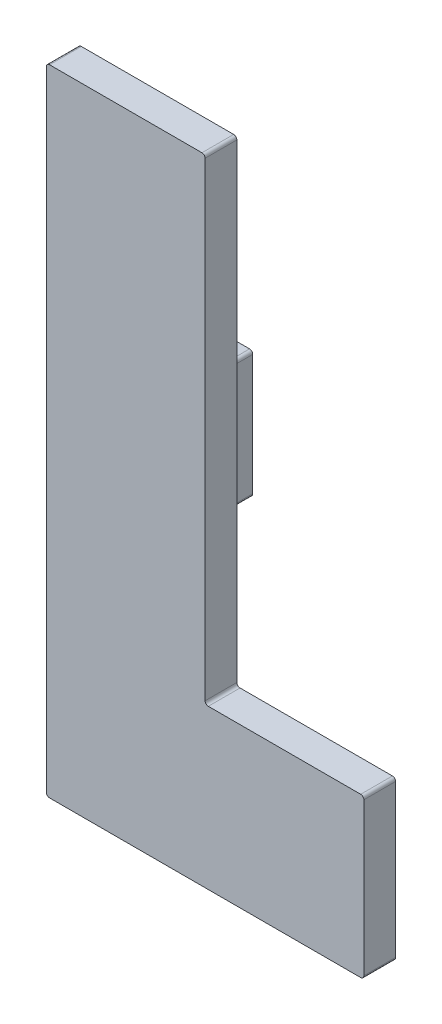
ISO-10303-21;
HEADER;
FILE_DESCRIPTION(('STEP AP214'),'2;1');
FILE_NAME('part.step','',(''),(''),'','','');
FILE_SCHEMA(('AUTOMOTIVE_DESIGN { 1 0 10303 214 1 1 1 1 }'));
ENDSEC;
DATA;
#1=APPLICATION_CONTEXT('core data for automotive mechanical design processes');
#2=APPLICATION_PROTOCOL_DEFINITION('international standard','automotive_design',2000,#1);
#3=PRODUCT_CONTEXT('',#1,'mechanical');
#4=PRODUCT('Part','Part','',(#3));
#5=PRODUCT_RELATED_PRODUCT_CATEGORY('part','',(#4));
#6=PRODUCT_DEFINITION_FORMATION('','',#4);
#7=PRODUCT_DEFINITION_CONTEXT('part definition',#1,'design');
#8=PRODUCT_DEFINITION('design','',#6,#7);
#9=PRODUCT_DEFINITION_SHAPE('','',#8);
#10=(LENGTH_UNIT() NAMED_UNIT(*) SI_UNIT(.MILLI.,.METRE.));
#11=(NAMED_UNIT(*) PLANE_ANGLE_UNIT() SI_UNIT($,.RADIAN.));
#12=(NAMED_UNIT(*) SI_UNIT($,.STERADIAN.) SOLID_ANGLE_UNIT());
#13=UNCERTAINTY_MEASURE_WITH_UNIT(LENGTH_MEASURE(1.E-05),#10,'distance_accuracy_value','');
#14=(GEOMETRIC_REPRESENTATION_CONTEXT(3) GLOBAL_UNCERTAINTY_ASSIGNED_CONTEXT((#13)) GLOBAL_UNIT_ASSIGNED_CONTEXT((#10,
#11,#12)) REPRESENTATION_CONTEXT('',''));
#15=CARTESIAN_POINT('',(0.,0.,0.));
#16=DIRECTION('',(0.,0.,1.));
#17=DIRECTION('',(1.,0.,0.));
#18=AXIS2_PLACEMENT_3D('',#15,#16,#17);
#19=CARTESIAN_POINT('',(0.,0.,0.));
#20=DIRECTION('',(0.,0.,1.));
#21=DIRECTION('',(1.,0.,0.));
#22=AXIS2_PLACEMENT_3D('',#19,#20,#21);
#23=PLANE('',#22);
#24=DIRECTION('',(0.,-1.,0.));
#25=VECTOR('',#24,1.);
#26=CARTESIAN_POINT('',(17.,60.,0.));
#27=LINE('',#26,#25);
#28=CARTESIAN_POINT('',(17.,38.5,0.));
#29=VERTEX_POINT('',#28);
#30=CARTESIAN_POINT('',(17.,61.5,0.));
#31=VERTEX_POINT('',#30);
#32=EDGE_CURVE('E282',#29,#31,#27,.F.);
#33=ORIENTED_EDGE('',*,*,#32,.T.);
#34=DIRECTION('',(1.,0.,0.));
#35=VECTOR('',#34,1.);
#36=CARTESIAN_POINT('',(9.5,61.5,0.));
#37=LINE('',#36,#35);
#38=CARTESIAN_POINT('',(8.,61.5,0.));
#39=VERTEX_POINT('',#38);
#40=EDGE_CURVE('E291',#31,#39,#37,.F.);
#41=ORIENTED_EDGE('',*,*,#40,.T.);
#42=DIRECTION('',(0.,1.,0.));
#43=VECTOR('',#42,1.);
#44=CARTESIAN_POINT('',(8.,40.,0.));
#45=LINE('',#44,#43);
#46=CARTESIAN_POINT('',(8.,38.5,0.));
#47=VERTEX_POINT('',#46);
#48=EDGE_CURVE('E288',#39,#47,#45,.F.);
#49=ORIENTED_EDGE('',*,*,#48,.T.);
#50=DIRECTION('',(-1.,0.,0.));
#51=VECTOR('',#50,1.);
#52=CARTESIAN_POINT('',(15.5,38.5,0.));
#53=LINE('',#52,#51);
#54=EDGE_CURVE('E285',#47,#29,#53,.F.);
#55=ORIENTED_EDGE('',*,*,#54,.T.);
#56=EDGE_LOOP('',(#33,#41,#49,#55));
#57=FACE_BOUND('',#56,.T.);
#58=DIRECTION('',(-1.,0.,0.));
#59=VECTOR('',#58,1.);
#60=CARTESIAN_POINT('',(50.,25.,0.));
#61=LINE('',#60,#59);
#62=CARTESIAN_POINT('',(49.5,25.,0.));
#63=VERTEX_POINT('',#62);
#64=CARTESIAN_POINT('',(25.5,25.,0.));
#65=VERTEX_POINT('',#64);
#66=EDGE_CURVE('E227',#63,#65,#61,.T.);
#67=ORIENTED_EDGE('',*,*,#66,.F.);
#68=CARTESIAN_POINT('',(49.5,24.5,0.));
#69=DIRECTION('',(0.,0.,1.));
#70=DIRECTION('',(1.,0.,0.));
#71=AXIS2_PLACEMENT_3D('',#68,#69,#70);
#72=CIRCLE('',#71,0.5);
#73=CARTESIAN_POINT('',(50.,24.5,0.));
#74=VERTEX_POINT('',#73);
#75=EDGE_CURVE('E248',#63,#74,#72,.F.);
#76=ORIENTED_EDGE('',*,*,#75,.T.);
#77=DIRECTION('',(0.,1.,0.));
#78=VECTOR('',#77,1.);
#79=CARTESIAN_POINT('',(50.,0.,0.));
#80=LINE('',#79,#78);
#81=CARTESIAN_POINT('',(50.,0.5,0.));
#82=VERTEX_POINT('',#81);
#83=EDGE_CURVE('E232',#82,#74,#80,.T.);
#84=ORIENTED_EDGE('',*,*,#83,.F.);
#85=CARTESIAN_POINT('',(49.5,0.5,0.));
#86=DIRECTION('',(0.,0.,1.));
#87=DIRECTION('',(1.,0.,0.));
#88=AXIS2_PLACEMENT_3D('',#85,#86,#87);
#89=CIRCLE('',#88,0.5);
#90=CARTESIAN_POINT('',(49.5,0.,0.));
#91=VERTEX_POINT('',#90);
#92=EDGE_CURVE('E246',#82,#91,#89,.F.);
#93=ORIENTED_EDGE('',*,*,#92,.T.);
#94=DIRECTION('',(1.,0.,0.));
#95=VECTOR('',#94,1.);
#96=CARTESIAN_POINT('',(0.,0.,0.));
#97=LINE('',#96,#95);
#98=CARTESIAN_POINT('',(0.5,0.,0.));
#99=VERTEX_POINT('',#98);
#100=EDGE_CURVE('E483',#99,#91,#97,.T.);
#101=ORIENTED_EDGE('',*,*,#100,.F.);
#102=CARTESIAN_POINT('',(0.5,0.5,0.));
#103=DIRECTION('',(0.,0.,1.));
#104=DIRECTION('',(1.,0.,0.));
#105=AXIS2_PLACEMENT_3D('',#102,#103,#104);
#106=CIRCLE('',#105,0.5);
#107=CARTESIAN_POINT('',(0.,0.5,0.));
#108=VERTEX_POINT('',#107);
#109=EDGE_CURVE('E244',#99,#108,#106,.F.);
#110=ORIENTED_EDGE('',*,*,#109,.T.);
#111=DIRECTION('',(0.,-1.,0.));
#112=VECTOR('',#111,1.);
#113=CARTESIAN_POINT('',(0.,100.,0.));
#114=LINE('',#113,#112);
#115=CARTESIAN_POINT('',(0.,99.5,0.));
#116=VERTEX_POINT('',#115);
#117=EDGE_CURVE('E464',#116,#108,#114,.T.);
#118=ORIENTED_EDGE('',*,*,#117,.F.);
#119=CARTESIAN_POINT('',(0.499999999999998,99.5,0.));
#120=DIRECTION('',(0.,0.,1.));
#121=DIRECTION('',(1.,0.,0.));
#122=AXIS2_PLACEMENT_3D('',#119,#120,#121);
#123=CIRCLE('',#122,0.5);
#124=CARTESIAN_POINT('',(0.499999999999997,100.,0.));
#125=VERTEX_POINT('',#124);
#126=EDGE_CURVE('E242',#116,#125,#123,.F.);
#127=ORIENTED_EDGE('',*,*,#126,.T.);
#128=DIRECTION('',(-1.,0.,0.));
#129=VECTOR('',#128,1.);
#130=CARTESIAN_POINT('',(25.,100.,0.));
#131=LINE('',#130,#129);
#132=CARTESIAN_POINT('',(24.5,100.,0.));
#133=VERTEX_POINT('',#132);
#134=EDGE_CURVE('E226',#133,#125,#131,.T.);
#135=ORIENTED_EDGE('',*,*,#134,.F.);
#136=CARTESIAN_POINT('',(24.5,99.5,0.));
#137=DIRECTION('',(0.,0.,1.));
#138=DIRECTION('',(1.,0.,0.));
#139=AXIS2_PLACEMENT_3D('',#136,#137,#138);
#140=CIRCLE('',#139,0.5);
#141=CARTESIAN_POINT('',(25.,99.5,0.));
#142=VERTEX_POINT('',#141);
#143=EDGE_CURVE('E225',#133,#142,#140,.F.);
#144=ORIENTED_EDGE('',*,*,#143,.T.);
#145=DIRECTION('',(0.,1.,0.));
#146=VECTOR('',#145,1.);
#147=CARTESIAN_POINT('',(25.,25.,0.));
#148=LINE('',#147,#146);
#149=CARTESIAN_POINT('',(25.,25.5,0.));
#150=VERTEX_POINT('',#149);
#151=EDGE_CURVE('E217',#150,#142,#148,.T.);
#152=ORIENTED_EDGE('',*,*,#151,.F.);
#153=CARTESIAN_POINT('',(25.5,25.5,0.));
#154=DIRECTION('',(0.,0.,1.));
#155=DIRECTION('',(1.,0.,0.));
#156=AXIS2_PLACEMENT_3D('',#153,#154,#155);
#157=CIRCLE('',#156,0.5);
#158=EDGE_CURVE('E200',#150,#65,#157,.T.);
#159=ORIENTED_EDGE('',*,*,#158,.T.);
#160=EDGE_LOOP('',(#67,#76,#84,#93,#101,#110,#118,#127,#135,#144,#152,#159));
#161=FACE_BOUND('',#160,.T.);
#162=ADVANCED_FACE('F49',(#57,#161),#23,.F.);
#163=CARTESIAN_POINT('',(0.,100.,5.));
#164=DIRECTION('',(1.,0.,0.));
#165=DIRECTION('',(0.,1.,0.));
#166=AXIS2_PLACEMENT_3D('',#163,#164,#165);
#167=PLANE('',#166);
#168=ORIENTED_EDGE('',*,*,#117,.T.);
#169=DIRECTION('',(0.,0.,-1.));
#170=VECTOR('',#169,1.);
#171=CARTESIAN_POINT('',(0.,0.5,5.));
#172=LINE('',#171,#170);
#173=CARTESIAN_POINT('',(0.,0.5,5.));
#174=VERTEX_POINT('',#173);
#175=EDGE_CURVE('E273',#108,#174,#172,.F.);
#176=ORIENTED_EDGE('',*,*,#175,.T.);
#177=DIRECTION('',(0.,-1.,0.));
#178=VECTOR('',#177,1.);
#179=CARTESIAN_POINT('',(0.,100.,5.));
#180=LINE('',#179,#178);
#181=CARTESIAN_POINT('',(0.,99.5,5.));
#182=VERTEX_POINT('',#181);
#183=EDGE_CURVE('E230',#182,#174,#180,.T.);
#184=ORIENTED_EDGE('',*,*,#183,.F.);
#185=DIRECTION('',(0.,0.,-1.));
#186=VECTOR('',#185,1.);
#187=CARTESIAN_POINT('',(0.,99.5,5.));
#188=LINE('',#187,#186);
#189=EDGE_CURVE('E270',#182,#116,#188,.T.);
#190=ORIENTED_EDGE('',*,*,#189,.T.);
#191=EDGE_LOOP('',(#168,#176,#184,#190));
#192=FACE_BOUND('',#191,.T.);
#193=ADVANCED_FACE('F512',(#192),#167,.F.);
#194=CARTESIAN_POINT('',(0.,0.,5.));
#195=DIRECTION('',(0.,1.,0.));
#196=DIRECTION('',(0.,0.,1.));
#197=AXIS2_PLACEMENT_3D('',#194,#195,#196);
#198=PLANE('',#197);
#199=ORIENTED_EDGE('',*,*,#100,.T.);
#200=DIRECTION('',(0.,0.,-1.));
#201=VECTOR('',#200,1.);
#202=CARTESIAN_POINT('',(49.5,0.,5.));
#203=LINE('',#202,#201);
#204=CARTESIAN_POINT('',(49.5,0.,5.));
#205=VERTEX_POINT('',#204);
#206=EDGE_CURVE('E268',#91,#205,#203,.F.);
#207=ORIENTED_EDGE('',*,*,#206,.T.);
#208=DIRECTION('',(1.,0.,0.));
#209=VECTOR('',#208,1.);
#210=CARTESIAN_POINT('',(0.,0.,5.));
#211=LINE('',#210,#209);
#212=CARTESIAN_POINT('',(0.5,0.,5.));
#213=VERTEX_POINT('',#212);
#214=EDGE_CURVE('E469',#213,#205,#211,.T.);
#215=ORIENTED_EDGE('',*,*,#214,.F.);
#216=DIRECTION('',(0.,0.,-1.));
#217=VECTOR('',#216,1.);
#218=CARTESIAN_POINT('',(0.5,0.,5.));
#219=LINE('',#218,#217);
#220=EDGE_CURVE('E265',#213,#99,#219,.T.);
#221=ORIENTED_EDGE('',*,*,#220,.T.);
#222=EDGE_LOOP('',(#199,#207,#215,#221));
#223=FACE_BOUND('',#222,.T.);
#224=ADVANCED_FACE('F509',(#223),#198,.F.);
#225=CARTESIAN_POINT('',(50.,0.,5.));
#226=DIRECTION('',(-1.,0.,0.));
#227=DIRECTION('',(0.,0.,1.));
#228=AXIS2_PLACEMENT_3D('',#225,#226,#227);
#229=PLANE('',#228);
#230=ORIENTED_EDGE('',*,*,#83,.T.);
#231=DIRECTION('',(0.,0.,-1.));
#232=VECTOR('',#231,1.);
#233=CARTESIAN_POINT('',(50.,24.5,5.));
#234=LINE('',#233,#232);
#235=CARTESIAN_POINT('',(50.,24.5,5.));
#236=VERTEX_POINT('',#235);
#237=EDGE_CURVE('E253',#74,#236,#234,.F.);
#238=ORIENTED_EDGE('',*,*,#237,.T.);
#239=DIRECTION('',(0.,1.,0.));
#240=VECTOR('',#239,1.);
#241=CARTESIAN_POINT('',(50.,0.,5.));
#242=LINE('',#241,#240);
#243=CARTESIAN_POINT('',(50.,0.5,5.));
#244=VERTEX_POINT('',#243);
#245=EDGE_CURVE('E472',#244,#236,#242,.T.);
#246=ORIENTED_EDGE('',*,*,#245,.F.);
#247=DIRECTION('',(0.,0.,-1.));
#248=VECTOR('',#247,1.);
#249=CARTESIAN_POINT('',(50.,0.5,5.));
#250=LINE('',#249,#248);
#251=EDGE_CURVE('E250',#244,#82,#250,.T.);
#252=ORIENTED_EDGE('',*,*,#251,.T.);
#253=EDGE_LOOP('',(#230,#238,#246,#252));
#254=FACE_BOUND('',#253,.T.);
#255=ADVANCED_FACE('F489',(#254),#229,.F.);
#256=CARTESIAN_POINT('',(50.,25.,5.));
#257=DIRECTION('',(0.,-1.,0.));
#258=DIRECTION('',(1.,0.,0.));
#259=AXIS2_PLACEMENT_3D('',#256,#257,#258);
#260=PLANE('',#259);
#261=ORIENTED_EDGE('',*,*,#66,.T.);
#262=DIRECTION('',(0.,0.,-1.));
#263=VECTOR('',#262,1.);
#264=CARTESIAN_POINT('',(25.5,25.,5.));
#265=LINE('',#264,#263);
#266=CARTESIAN_POINT('',(25.5,25.,5.));
#267=VERTEX_POINT('',#266);
#268=EDGE_CURVE('E205',#65,#267,#265,.F.);
#269=ORIENTED_EDGE('',*,*,#268,.T.);
#270=DIRECTION('',(-1.,0.,0.));
#271=VECTOR('',#270,1.);
#272=CARTESIAN_POINT('',(50.,25.,5.));
#273=LINE('',#272,#271);
#274=CARTESIAN_POINT('',(49.5,25.,5.));
#275=VERTEX_POINT('',#274);
#276=EDGE_CURVE('E475',#275,#267,#273,.T.);
#277=ORIENTED_EDGE('',*,*,#276,.F.);
#278=DIRECTION('',(0.,0.,-1.));
#279=VECTOR('',#278,1.);
#280=CARTESIAN_POINT('',(49.5,25.,5.));
#281=LINE('',#280,#279);
#282=EDGE_CURVE('E221',#275,#63,#281,.T.);
#283=ORIENTED_EDGE('',*,*,#282,.T.);
#284=EDGE_LOOP('',(#261,#269,#277,#283));
#285=FACE_BOUND('',#284,.T.);
#286=ADVANCED_FACE('F500',(#285),#260,.F.);
#287=CARTESIAN_POINT('',(25.,25.,5.));
#288=DIRECTION('',(-1.,0.,0.));
#289=DIRECTION('',(0.,-1.,0.));
#290=AXIS2_PLACEMENT_3D('',#287,#288,#289);
#291=PLANE('',#290);
#292=DIRECTION('',(0.,1.,0.));
#293=VECTOR('',#292,1.);
#294=CARTESIAN_POINT('',(25.,25.,5.));
#295=LINE('',#294,#293);
#296=CARTESIAN_POINT('',(25.,25.5,5.));
#297=VERTEX_POINT('',#296);
#298=CARTESIAN_POINT('',(25.,99.5,5.));
#299=VERTEX_POINT('',#298);
#300=EDGE_CURVE('E220',#297,#299,#295,.T.);
#301=ORIENTED_EDGE('',*,*,#300,.F.);
#302=DIRECTION('',(0.,0.,-1.));
#303=VECTOR('',#302,1.);
#304=CARTESIAN_POINT('',(25.,25.5,0.));
#305=LINE('',#304,#303);
#306=EDGE_CURVE('E204',#297,#150,#305,.T.);
#307=ORIENTED_EDGE('',*,*,#306,.T.);
#308=ORIENTED_EDGE('',*,*,#151,.T.);
#309=DIRECTION('',(0.,0.,-1.));
#310=VECTOR('',#309,1.);
#311=CARTESIAN_POINT('',(25.,99.5,5.));
#312=LINE('',#311,#310);
#313=EDGE_CURVE('E222',#142,#299,#312,.F.);
#314=ORIENTED_EDGE('',*,*,#313,.T.);
#315=EDGE_LOOP('',(#301,#307,#308,#314));
#316=FACE_BOUND('',#315,.T.);
#317=ADVANCED_FACE('F216',(#316),#291,.F.);
#318=CARTESIAN_POINT('',(25.,100.,5.));
#319=DIRECTION('',(0.,-1.,0.));
#320=DIRECTION('',(0.,0.,-1.));
#321=AXIS2_PLACEMENT_3D('',#318,#319,#320);
#322=PLANE('',#321);
#323=ORIENTED_EDGE('',*,*,#134,.T.);
#324=DIRECTION('',(0.,0.,-1.));
#325=VECTOR('',#324,1.);
#326=CARTESIAN_POINT('',(0.499999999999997,100.,5.));
#327=LINE('',#326,#325);
#328=CARTESIAN_POINT('',(0.499999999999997,100.,5.));
#329=VERTEX_POINT('',#328);
#330=EDGE_CURVE('E211',#125,#329,#327,.F.);
#331=ORIENTED_EDGE('',*,*,#330,.T.);
#332=DIRECTION('',(-1.,0.,0.));
#333=VECTOR('',#332,1.);
#334=CARTESIAN_POINT('',(25.,100.,5.));
#335=LINE('',#334,#333);
#336=CARTESIAN_POINT('',(24.5,100.,5.));
#337=VERTEX_POINT('',#336);
#338=EDGE_CURVE('E236',#337,#329,#335,.T.);
#339=ORIENTED_EDGE('',*,*,#338,.F.);
#340=DIRECTION('',(0.,0.,-1.));
#341=VECTOR('',#340,1.);
#342=CARTESIAN_POINT('',(24.5,100.,5.));
#343=LINE('',#342,#341);
#344=EDGE_CURVE('E275',#337,#133,#343,.T.);
#345=ORIENTED_EDGE('',*,*,#344,.T.);
#346=EDGE_LOOP('',(#323,#331,#339,#345));
#347=FACE_BOUND('',#346,.T.);
#348=ADVANCED_FACE('F507',(#347),#322,.F.);
#349=CARTESIAN_POINT('',(0.,0.,5.));
#350=DIRECTION('',(0.,0.,1.));
#351=DIRECTION('',(1.,0.,0.));
#352=AXIS2_PLACEMENT_3D('',#349,#350,#351);
#353=PLANE('',#352);
#354=ORIENTED_EDGE('',*,*,#245,.T.);
#355=CARTESIAN_POINT('',(49.5,24.5,5.));
#356=DIRECTION('',(0.,0.,1.));
#357=DIRECTION('',(1.,0.,0.));
#358=AXIS2_PLACEMENT_3D('',#355,#356,#357);
#359=CIRCLE('',#358,0.5);
#360=EDGE_CURVE('E263',#236,#275,#359,.T.);
#361=ORIENTED_EDGE('',*,*,#360,.T.);
#362=ORIENTED_EDGE('',*,*,#276,.T.);
#363=CARTESIAN_POINT('',(25.5,25.5,5.));
#364=DIRECTION('',(0.,0.,1.));
#365=DIRECTION('',(1.,0.,0.));
#366=AXIS2_PLACEMENT_3D('',#363,#364,#365);
#367=CIRCLE('',#366,0.5);
#368=EDGE_CURVE('E210',#267,#297,#367,.F.);
#369=ORIENTED_EDGE('',*,*,#368,.T.);
#370=ORIENTED_EDGE('',*,*,#300,.T.);
#371=CARTESIAN_POINT('',(24.5,99.5,5.));
#372=DIRECTION('',(0.,0.,1.));
#373=DIRECTION('',(1.,0.,0.));
#374=AXIS2_PLACEMENT_3D('',#371,#372,#373);
#375=CIRCLE('',#374,0.5);
#376=EDGE_CURVE('E255',#299,#337,#375,.T.);
#377=ORIENTED_EDGE('',*,*,#376,.T.);
#378=ORIENTED_EDGE('',*,*,#338,.T.);
#379=CARTESIAN_POINT('',(0.499999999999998,99.5,5.));
#380=DIRECTION('',(0.,0.,1.));
#381=DIRECTION('',(1.,0.,0.));
#382=AXIS2_PLACEMENT_3D('',#379,#380,#381);
#383=CIRCLE('',#382,0.5);
#384=EDGE_CURVE('E257',#329,#182,#383,.T.);
#385=ORIENTED_EDGE('',*,*,#384,.T.);
#386=ORIENTED_EDGE('',*,*,#183,.T.);
#387=CARTESIAN_POINT('',(0.5,0.5,5.));
#388=DIRECTION('',(0.,0.,1.));
#389=DIRECTION('',(1.,0.,0.));
#390=AXIS2_PLACEMENT_3D('',#387,#388,#389);
#391=CIRCLE('',#390,0.5);
#392=EDGE_CURVE('E259',#174,#213,#391,.T.);
#393=ORIENTED_EDGE('',*,*,#392,.T.);
#394=ORIENTED_EDGE('',*,*,#214,.T.);
#395=CARTESIAN_POINT('',(49.5,0.5,5.));
#396=DIRECTION('',(0.,0.,1.));
#397=DIRECTION('',(1.,0.,0.));
#398=AXIS2_PLACEMENT_3D('',#395,#396,#397);
#399=CIRCLE('',#398,0.5);
#400=EDGE_CURVE('E261',#205,#244,#399,.T.);
#401=ORIENTED_EDGE('',*,*,#400,.T.);
#402=EDGE_LOOP('',(#354,#361,#362,#369,#370,#377,#378,#385,#386,#393,#394,#401));
#403=FACE_BOUND('',#402,.T.);
#404=ADVANCED_FACE('F498',(#403),#353,.T.);
#405=CARTESIAN_POINT('',(25.5,25.5,5.));
#406=DIRECTION('',(0.,0.,1.));
#407=DIRECTION('',(1.,0.,0.));
#408=AXIS2_PLACEMENT_3D('',#405,#406,#407);
#409=CYLINDRICAL_SURFACE('',#408,0.5);
#410=ORIENTED_EDGE('',*,*,#368,.F.);
#411=ORIENTED_EDGE('',*,*,#268,.F.);
#412=ORIENTED_EDGE('',*,*,#158,.F.);
#413=ORIENTED_EDGE('',*,*,#306,.F.);
#414=EDGE_LOOP('',(#410,#411,#412,#413));
#415=FACE_BOUND('',#414,.T.);
#416=ADVANCED_FACE('F203',(#415),#409,.F.);
#417=CARTESIAN_POINT('',(49.5,24.5,5.));
#418=DIRECTION('',(0.,0.,-1.));
#419=DIRECTION('',(-1.,0.,0.));
#420=AXIS2_PLACEMENT_3D('',#417,#418,#419);
#421=CYLINDRICAL_SURFACE('',#420,0.5);
#422=ORIENTED_EDGE('',*,*,#360,.F.);
#423=ORIENTED_EDGE('',*,*,#237,.F.);
#424=ORIENTED_EDGE('',*,*,#75,.F.);
#425=ORIENTED_EDGE('',*,*,#282,.F.);
#426=EDGE_LOOP('',(#422,#423,#424,#425));
#427=FACE_BOUND('',#426,.T.);
#428=ADVANCED_FACE('F494',(#427),#421,.T.);
#429=CARTESIAN_POINT('',(49.5,0.5,5.));
#430=DIRECTION('',(0.,0.,-1.));
#431=DIRECTION('',(-1.,0.,0.));
#432=AXIS2_PLACEMENT_3D('',#429,#430,#431);
#433=CYLINDRICAL_SURFACE('',#432,0.5);
#434=ORIENTED_EDGE('',*,*,#400,.F.);
#435=ORIENTED_EDGE('',*,*,#206,.F.);
#436=ORIENTED_EDGE('',*,*,#92,.F.);
#437=ORIENTED_EDGE('',*,*,#251,.F.);
#438=EDGE_LOOP('',(#434,#435,#436,#437));
#439=FACE_BOUND('',#438,.T.);
#440=ADVANCED_FACE('F549',(#439),#433,.T.);
#441=CARTESIAN_POINT('',(0.5,0.5,5.));
#442=DIRECTION('',(0.,0.,-1.));
#443=DIRECTION('',(-1.,0.,0.));
#444=AXIS2_PLACEMENT_3D('',#441,#442,#443);
#445=CYLINDRICAL_SURFACE('',#444,0.5);
#446=ORIENTED_EDGE('',*,*,#392,.F.);
#447=ORIENTED_EDGE('',*,*,#175,.F.);
#448=ORIENTED_EDGE('',*,*,#109,.F.);
#449=ORIENTED_EDGE('',*,*,#220,.F.);
#450=EDGE_LOOP('',(#446,#447,#448,#449));
#451=FACE_BOUND('',#450,.T.);
#452=ADVANCED_FACE('F541',(#451),#445,.T.);
#453=CARTESIAN_POINT('',(0.499999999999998,99.5,5.));
#454=DIRECTION('',(0.,0.,-1.));
#455=DIRECTION('',(-1.,0.,0.));
#456=AXIS2_PLACEMENT_3D('',#453,#454,#455);
#457=CYLINDRICAL_SURFACE('',#456,0.5);
#458=ORIENTED_EDGE('',*,*,#384,.F.);
#459=ORIENTED_EDGE('',*,*,#330,.F.);
#460=ORIENTED_EDGE('',*,*,#126,.F.);
#461=ORIENTED_EDGE('',*,*,#189,.F.);
#462=EDGE_LOOP('',(#458,#459,#460,#461));
#463=FACE_BOUND('',#462,.T.);
#464=ADVANCED_FACE('F534',(#463),#457,.T.);
#465=CARTESIAN_POINT('',(24.5,99.5,5.));
#466=DIRECTION('',(0.,0.,-1.));
#467=DIRECTION('',(-1.,0.,0.));
#468=AXIS2_PLACEMENT_3D('',#465,#466,#467);
#469=CYLINDRICAL_SURFACE('',#468,0.5);
#470=ORIENTED_EDGE('',*,*,#376,.F.);
#471=ORIENTED_EDGE('',*,*,#313,.F.);
#472=ORIENTED_EDGE('',*,*,#143,.F.);
#473=ORIENTED_EDGE('',*,*,#344,.F.);
#474=EDGE_LOOP('',(#470,#471,#472,#473));
#475=FACE_BOUND('',#474,.T.);
#476=ADVANCED_FACE('F387',(#475),#469,.T.);
#477=CARTESIAN_POINT('',(15.5,60.,-12.));
#478=DIRECTION('',(-1.,0.,0.));
#479=DIRECTION('',(0.,0.,1.));
#480=AXIS2_PLACEMENT_3D('',#477,#478,#479);
#481=PLANE('',#480);
#482=DIRECTION('',(0.,-1.,0.));
#483=VECTOR('',#482,1.);
#484=CARTESIAN_POINT('',(15.5,40.,-1.5));
#485=LINE('',#484,#483);
#486=CARTESIAN_POINT('',(15.5,59.5,-1.5));
#487=VERTEX_POINT('',#486);
#488=CARTESIAN_POINT('',(15.5,40.5,-1.5));
#489=VERTEX_POINT('',#488);
#490=EDGE_CURVE('E300',#487,#489,#485,.T.);
#491=ORIENTED_EDGE('',*,*,#490,.T.);
#492=DIRECTION('',(0.,0.,1.));
#493=VECTOR('',#492,1.);
#494=CARTESIAN_POINT('',(15.5,40.5,-12.));
#495=LINE('',#494,#493);
#496=CARTESIAN_POINT('',(15.5,40.5,-12.));
#497=VERTEX_POINT('',#496);
#498=EDGE_CURVE('E340',#489,#497,#495,.F.);
#499=ORIENTED_EDGE('',*,*,#498,.T.);
#500=DIRECTION('',(0.,-1.,0.));
#501=VECTOR('',#500,1.);
#502=CARTESIAN_POINT('',(15.5,60.,-12.));
#503=LINE('',#502,#501);
#504=CARTESIAN_POINT('',(15.5,59.5,-12.));
#505=VERTEX_POINT('',#504);
#506=EDGE_CURVE('E346',#505,#497,#503,.T.);
#507=ORIENTED_EDGE('',*,*,#506,.F.);
#508=DIRECTION('',(0.,0.,1.));
#509=VECTOR('',#508,1.);
#510=CARTESIAN_POINT('',(15.5,59.5,-12.));
#511=LINE('',#510,#509);
#512=EDGE_CURVE('E338',#505,#487,#511,.T.);
#513=ORIENTED_EDGE('',*,*,#512,.T.);
#514=EDGE_LOOP('',(#491,#499,#507,#513));
#515=FACE_BOUND('',#514,.T.);
#516=ADVANCED_FACE('F422',(#515),#481,.F.);
#517=CARTESIAN_POINT('',(15.5,40.,-12.));
#518=DIRECTION('',(0.,1.,0.));
#519=DIRECTION('',(0.,0.,1.));
#520=AXIS2_PLACEMENT_3D('',#517,#518,#519);
#521=PLANE('',#520);
#522=DIRECTION('',(-1.,0.,0.));
#523=VECTOR('',#522,1.);
#524=CARTESIAN_POINT('',(9.5,40.,-1.5));
#525=LINE('',#524,#523);
#526=CARTESIAN_POINT('',(15.,40.,-1.5));
#527=VERTEX_POINT('',#526);
#528=CARTESIAN_POINT('',(10.,40.,-1.5));
#529=VERTEX_POINT('',#528);
#530=EDGE_CURVE('E297',#527,#529,#525,.T.);
#531=ORIENTED_EDGE('',*,*,#530,.T.);
#532=DIRECTION('',(0.,0.,1.));
#533=VECTOR('',#532,1.);
#534=CARTESIAN_POINT('',(10.,40.,-12.));
#535=LINE('',#534,#533);
#536=CARTESIAN_POINT('',(10.,40.,-12.));
#537=VERTEX_POINT('',#536);
#538=EDGE_CURVE('E329',#529,#537,#535,.F.);
#539=ORIENTED_EDGE('',*,*,#538,.T.);
#540=DIRECTION('',(-1.,0.,0.));
#541=VECTOR('',#540,1.);
#542=CARTESIAN_POINT('',(15.5,40.,-12.));
#543=LINE('',#542,#541);
#544=CARTESIAN_POINT('',(15.,40.,-12.));
#545=VERTEX_POINT('',#544);
#546=EDGE_CURVE('E452',#545,#537,#543,.T.);
#547=ORIENTED_EDGE('',*,*,#546,.F.);
#548=DIRECTION('',(0.,0.,1.));
#549=VECTOR('',#548,1.);
#550=CARTESIAN_POINT('',(15.,40.,-12.));
#551=LINE('',#550,#549);
#552=EDGE_CURVE('E327',#545,#527,#551,.T.);
#553=ORIENTED_EDGE('',*,*,#552,.T.);
#554=EDGE_LOOP('',(#531,#539,#547,#553));
#555=FACE_BOUND('',#554,.T.);
#556=ADVANCED_FACE('F442',(#555),#521,.F.);
#557=CARTESIAN_POINT('',(9.5,60.,-12.));
#558=DIRECTION('',(1.,0.,0.));
#559=DIRECTION('',(0.,0.,-1.));
#560=AXIS2_PLACEMENT_3D('',#557,#558,#559);
#561=PLANE('',#560);
#562=DIRECTION('',(0.,1.,0.));
#563=VECTOR('',#562,1.);
#564=CARTESIAN_POINT('',(9.5,60.,-12.));
#565=LINE('',#564,#563);
#566=CARTESIAN_POINT('',(9.5,40.5,-12.));
#567=VERTEX_POINT('',#566);
#568=CARTESIAN_POINT('',(9.5,59.5,-12.));
#569=VERTEX_POINT('',#568);
#570=EDGE_CURVE('E451',#567,#569,#565,.T.);
#571=ORIENTED_EDGE('',*,*,#570,.F.);
#572=DIRECTION('',(0.,0.,1.));
#573=VECTOR('',#572,1.);
#574=CARTESIAN_POINT('',(9.5,40.5,-12.));
#575=LINE('',#574,#573);
#576=CARTESIAN_POINT('',(9.5,40.5,-1.5));
#577=VERTEX_POINT('',#576);
#578=EDGE_CURVE('E325',#567,#577,#575,.T.);
#579=ORIENTED_EDGE('',*,*,#578,.T.);
#580=DIRECTION('',(0.,1.,0.));
#581=VECTOR('',#580,1.);
#582=CARTESIAN_POINT('',(9.5,60.,-1.5));
#583=LINE('',#582,#581);
#584=CARTESIAN_POINT('',(9.5,59.5,-1.5));
#585=VERTEX_POINT('',#584);
#586=EDGE_CURVE('E294',#577,#585,#583,.T.);
#587=ORIENTED_EDGE('',*,*,#586,.T.);
#588=DIRECTION('',(0.,0.,1.));
#589=VECTOR('',#588,1.);
#590=CARTESIAN_POINT('',(9.5,59.5,-12.));
#591=LINE('',#590,#589);
#592=EDGE_CURVE('E323',#585,#569,#591,.F.);
#593=ORIENTED_EDGE('',*,*,#592,.T.);
#594=EDGE_LOOP('',(#571,#579,#587,#593));
#595=FACE_BOUND('',#594,.T.);
#596=ADVANCED_FACE('F454',(#595),#561,.F.);
#597=CARTESIAN_POINT('',(15.5,60.,-12.));
#598=DIRECTION('',(0.,-1.,0.));
#599=DIRECTION('',(0.,0.,-1.));
#600=AXIS2_PLACEMENT_3D('',#597,#598,#599);
#601=PLANE('',#600);
#602=DIRECTION('',(1.,0.,0.));
#603=VECTOR('',#602,1.);
#604=CARTESIAN_POINT('',(15.5,60.,-1.5));
#605=LINE('',#604,#603);
#606=CARTESIAN_POINT('',(10.,60.,-1.5));
#607=VERTEX_POINT('',#606);
#608=CARTESIAN_POINT('',(15.,60.,-1.5));
#609=VERTEX_POINT('',#608);
#610=EDGE_CURVE('E280',#607,#609,#605,.T.);
#611=ORIENTED_EDGE('',*,*,#610,.T.);
#612=DIRECTION('',(0.,0.,1.));
#613=VECTOR('',#612,1.);
#614=CARTESIAN_POINT('',(15.,60.,-12.));
#615=LINE('',#614,#613);
#616=CARTESIAN_POINT('',(15.,60.,-12.));
#617=VERTEX_POINT('',#616);
#618=EDGE_CURVE('E11',#609,#617,#615,.F.);
#619=ORIENTED_EDGE('',*,*,#618,.T.);
#620=DIRECTION('',(1.,0.,0.));
#621=VECTOR('',#620,1.);
#622=CARTESIAN_POINT('',(15.5,60.,-12.));
#623=LINE('',#622,#621);
#624=CARTESIAN_POINT('',(10.,60.,-12.));
#625=VERTEX_POINT('',#624);
#626=EDGE_CURVE('E430',#625,#617,#623,.T.);
#627=ORIENTED_EDGE('',*,*,#626,.F.);
#628=DIRECTION('',(0.,0.,1.));
#629=VECTOR('',#628,1.);
#630=CARTESIAN_POINT('',(10.,60.,-12.));
#631=LINE('',#630,#629);
#632=EDGE_CURVE('E58',#625,#607,#631,.T.);
#633=ORIENTED_EDGE('',*,*,#632,.T.);
#634=EDGE_LOOP('',(#611,#619,#627,#633));
#635=FACE_BOUND('',#634,.T.);
#636=ADVANCED_FACE('F428',(#635),#601,.F.);
#637=CARTESIAN_POINT('',(0.,0.,-12.));
#638=DIRECTION('',(0.,0.,-1.));
#639=DIRECTION('',(-1.,0.,0.));
#640=AXIS2_PLACEMENT_3D('',#637,#638,#639);
#641=PLANE('',#640);
#642=ORIENTED_EDGE('',*,*,#546,.T.);
#643=CARTESIAN_POINT('',(10.,40.5,-12.));
#644=DIRECTION('',(0.,0.,-1.));
#645=DIRECTION('',(-1.,0.,0.));
#646=AXIS2_PLACEMENT_3D('',#643,#644,#645);
#647=CIRCLE('',#646,0.5);
#648=EDGE_CURVE('E336',#537,#567,#647,.T.);
#649=ORIENTED_EDGE('',*,*,#648,.T.);
#650=ORIENTED_EDGE('',*,*,#570,.T.);
#651=CARTESIAN_POINT('',(10.,59.5,-12.));
#652=DIRECTION('',(0.,0.,-1.));
#653=DIRECTION('',(-1.,0.,0.));
#654=AXIS2_PLACEMENT_3D('',#651,#652,#653);
#655=CIRCLE('',#654,0.5);
#656=EDGE_CURVE('E71',#569,#625,#655,.T.);
#657=ORIENTED_EDGE('',*,*,#656,.T.);
#658=ORIENTED_EDGE('',*,*,#626,.T.);
#659=CARTESIAN_POINT('',(15.,59.5,-12.));
#660=DIRECTION('',(0.,0.,-1.));
#661=DIRECTION('',(-1.,0.,0.));
#662=AXIS2_PLACEMENT_3D('',#659,#660,#661);
#663=CIRCLE('',#662,0.5);
#664=EDGE_CURVE('E332',#617,#505,#663,.T.);
#665=ORIENTED_EDGE('',*,*,#664,.T.);
#666=ORIENTED_EDGE('',*,*,#506,.T.);
#667=CARTESIAN_POINT('',(15.,40.5,-12.));
#668=DIRECTION('',(0.,0.,-1.));
#669=DIRECTION('',(-1.,0.,0.));
#670=AXIS2_PLACEMENT_3D('',#667,#668,#669);
#671=CIRCLE('',#670,0.5);
#672=EDGE_CURVE('E334',#497,#545,#671,.T.);
#673=ORIENTED_EDGE('',*,*,#672,.T.);
#674=EDGE_LOOP('',(#642,#649,#650,#657,#658,#665,#666,#673));
#675=FACE_BOUND('',#674,.T.);
#676=ADVANCED_FACE('F450',(#675),#641,.T.);
#677=CARTESIAN_POINT('',(15.5,38.5,-1.5));
#678=DIRECTION('',(1.,0.,0.));
#679=DIRECTION('',(0.,0.,-1.));
#680=AXIS2_PLACEMENT_3D('',#677,#678,#679);
#681=CYLINDRICAL_SURFACE('',#680,1.5);
#682=ORIENTED_EDGE('',*,*,#54,.F.);
#683=CARTESIAN_POINT('',(8.,38.5,-1.5));
#684=DIRECTION('',(-0.6,0.799999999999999,0.));
#685=DIRECTION('',(-0.8,-0.6,0.));
#686=AXIS2_PLACEMENT_3D('',#683,#684,#685);
#687=ELLIPSE('',#686,2.5,1.5);
#688=EDGE_CURVE('E310',#47,#529,#687,.T.);
#689=ORIENTED_EDGE('',*,*,#688,.T.);
#690=ORIENTED_EDGE('',*,*,#530,.F.);
#691=CARTESIAN_POINT('',(17.,38.5,-1.5));
#692=DIRECTION('',(-0.6,-0.799999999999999,0.));
#693=DIRECTION('',(-0.8,0.600000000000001,0.));
#694=AXIS2_PLACEMENT_3D('',#691,#692,#693);
#695=ELLIPSE('',#694,2.5,1.5);
#696=EDGE_CURVE('E308',#527,#29,#695,.F.);
#697=ORIENTED_EDGE('',*,*,#696,.T.);
#698=EDGE_LOOP('',(#682,#689,#690,#697));
#699=FACE_BOUND('',#698,.T.);
#700=ADVANCED_FACE('F362',(#699),#681,.F.);
#701=CARTESIAN_POINT('',(8.,60.,-1.5));
#702=DIRECTION('',(0.,-1.,0.));
#703=DIRECTION('',(0.,0.,-1.));
#704=AXIS2_PLACEMENT_3D('',#701,#702,#703);
#705=CYLINDRICAL_SURFACE('',#704,1.5);
#706=ORIENTED_EDGE('',*,*,#586,.F.);
#707=CARTESIAN_POINT('',(8.,38.5,-1.5));
#708=DIRECTION('',(-0.8,0.599999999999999,0.));
#709=DIRECTION('',(-0.6,-0.8,0.));
#710=AXIS2_PLACEMENT_3D('',#707,#708,#709);
#711=ELLIPSE('',#710,2.5,1.5);
#712=EDGE_CURVE('E305',#577,#47,#711,.F.);
#713=ORIENTED_EDGE('',*,*,#712,.T.);
#714=ORIENTED_EDGE('',*,*,#48,.F.);
#715=CARTESIAN_POINT('',(8.,61.5,-1.5));
#716=DIRECTION('',(0.8,0.6,0.));
#717=DIRECTION('',(-0.6,0.8,0.));
#718=AXIS2_PLACEMENT_3D('',#715,#716,#717);
#719=ELLIPSE('',#718,2.5,1.5);
#720=EDGE_CURVE('E303',#39,#585,#719,.T.);
#721=ORIENTED_EDGE('',*,*,#720,.T.);
#722=EDGE_LOOP('',(#706,#713,#714,#721));
#723=FACE_BOUND('',#722,.T.);
#724=ADVANCED_FACE('F365',(#723),#705,.F.);
#725=CARTESIAN_POINT('',(17.,60.,-1.5));
#726=DIRECTION('',(0.,1.,0.));
#727=DIRECTION('',(0.,0.,1.));
#728=AXIS2_PLACEMENT_3D('',#725,#726,#727);
#729=CYLINDRICAL_SURFACE('',#728,1.5);
#730=ORIENTED_EDGE('',*,*,#32,.F.);
#731=CARTESIAN_POINT('',(17.,38.5,-1.5));
#732=DIRECTION('',(-0.8,-0.6,0.));
#733=DIRECTION('',(-0.6,0.8,0.));
#734=AXIS2_PLACEMENT_3D('',#731,#732,#733);
#735=ELLIPSE('',#734,2.5,1.5);
#736=EDGE_CURVE('E314',#29,#489,#735,.T.);
#737=ORIENTED_EDGE('',*,*,#736,.T.);
#738=ORIENTED_EDGE('',*,*,#490,.F.);
#739=CARTESIAN_POINT('',(17.,61.5,-1.5));
#740=DIRECTION('',(0.799999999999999,-0.6,0.));
#741=DIRECTION('',(-0.600000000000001,-0.8,0.));
#742=AXIS2_PLACEMENT_3D('',#739,#740,#741);
#743=ELLIPSE('',#742,2.5,1.5);
#744=EDGE_CURVE('E312',#487,#31,#743,.F.);
#745=ORIENTED_EDGE('',*,*,#744,.T.);
#746=EDGE_LOOP('',(#730,#737,#738,#745));
#747=FACE_BOUND('',#746,.T.);
#748=ADVANCED_FACE('F369',(#747),#729,.F.);
#749=CARTESIAN_POINT('',(15.5,61.5,-1.5));
#750=DIRECTION('',(-1.,0.,0.));
#751=DIRECTION('',(0.,0.,1.));
#752=AXIS2_PLACEMENT_3D('',#749,#750,#751);
#753=CYLINDRICAL_SURFACE('',#752,1.5);
#754=ORIENTED_EDGE('',*,*,#40,.F.);
#755=CARTESIAN_POINT('',(17.,61.5,-1.5));
#756=DIRECTION('',(0.6,-0.8,0.));
#757=DIRECTION('',(-0.8,-0.6,0.));
#758=AXIS2_PLACEMENT_3D('',#755,#756,#757);
#759=ELLIPSE('',#758,2.5,1.5);
#760=EDGE_CURVE('E320',#31,#609,#759,.T.);
#761=ORIENTED_EDGE('',*,*,#760,.T.);
#762=ORIENTED_EDGE('',*,*,#610,.F.);
#763=CARTESIAN_POINT('',(8.,61.5,-1.5));
#764=DIRECTION('',(0.599999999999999,0.8,0.));
#765=DIRECTION('',(-0.8,0.599999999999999,0.));
#766=AXIS2_PLACEMENT_3D('',#763,#764,#765);
#767=ELLIPSE('',#766,2.5,1.5);
#768=EDGE_CURVE('E317',#607,#39,#767,.F.);
#769=ORIENTED_EDGE('',*,*,#768,.T.);
#770=EDGE_LOOP('',(#754,#761,#762,#769));
#771=FACE_BOUND('',#770,.T.);
#772=ADVANCED_FACE('F382',(#771),#753,.F.);
#773=CARTESIAN_POINT('',(10.,40.5,-12.));
#774=DIRECTION('',(0.,0.,1.));
#775=DIRECTION('',(1.,0.,0.));
#776=AXIS2_PLACEMENT_3D('',#773,#774,#775);
#777=CYLINDRICAL_SURFACE('',#776,0.5);
#778=ORIENTED_EDGE('',*,*,#648,.F.);
#779=ORIENTED_EDGE('',*,*,#538,.F.);
#780=CARTESIAN_POINT('',(10.,40.5,-1.5));
#781=DIRECTION('',(0.,0.,1.));
#782=DIRECTION('',(1.,0.,0.));
#783=AXIS2_PLACEMENT_3D('',#780,#781,#782);
#784=CIRCLE('',#783,0.5);
#785=EDGE_CURVE('E343',#577,#529,#784,.T.);
#786=ORIENTED_EDGE('',*,*,#785,.F.);
#787=ORIENTED_EDGE('',*,*,#578,.F.);
#788=EDGE_LOOP('',(#778,#779,#786,#787));
#789=FACE_BOUND('',#788,.T.);
#790=ADVANCED_FACE('F360',(#789),#777,.T.);
#791=CARTESIAN_POINT('',(8.,38.5,-3.));
#792=CARTESIAN_POINT('',(8.,38.5,-3.));
#793=CARTESIAN_POINT('',(8.,38.5,-3.));
#794=CARTESIAN_POINT('',(8.08712949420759,38.5653471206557,-2.99997370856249));
#795=CARTESIAN_POINT('',(8.07625349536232,38.5762534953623,-3.00009886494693));
#796=CARTESIAN_POINT('',(8.06534712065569,38.5871294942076,-2.99997370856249));
#797=CARTESIAN_POINT('',(8.17428123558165,38.6307109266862,-2.99572763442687));
#798=CARTESIAN_POINT('',(8.15271684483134,38.6527168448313,-2.99430068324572));
#799=CARTESIAN_POINT('',(8.13071092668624,38.6742812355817,-2.99572763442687));
#800=CARTESIAN_POINT('',(8.34708598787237,38.7603144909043,-2.97867971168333));
#801=CARTESIAN_POINT('',(8.30334975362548,38.8033497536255,-2.97154804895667));
#802=CARTESIAN_POINT('',(8.26031449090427,38.8470859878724,-2.97867971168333));
#803=CARTESIAN_POINT('',(8.43274544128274,38.8245590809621,-2.96595089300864));
#804=CARTESIAN_POINT('',(8.37795185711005,38.8779518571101,-2.95456095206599));
#805=CARTESIAN_POINT('',(8.32455908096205,38.9327454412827,-2.96595089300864));
#806=CARTESIAN_POINT('',(8.60110683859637,38.9508301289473,-2.93211276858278));
#807=CARTESIAN_POINT('',(8.52302076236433,39.0230207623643,-2.90986913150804));
#808=CARTESIAN_POINT('',(8.45083012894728,39.1011068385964,-2.93211276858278));
#809=CARTESIAN_POINT('',(8.68383428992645,39.0128757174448,-2.91114760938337));
#810=CARTESIAN_POINT('',(8.59391468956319,39.0939146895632,-2.88210022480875));
#811=CARTESIAN_POINT('',(8.51287571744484,39.1838342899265,-2.91114760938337));
#812=CARTESIAN_POINT('',(8.84489093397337,39.13366820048,-2.86111493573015));
#813=CARTESIAN_POINT('',(8.72979458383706,39.2297945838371,-2.81681547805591));
#814=CARTESIAN_POINT('',(8.63366820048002,39.3448909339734,-2.86111493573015));
#815=CARTESIAN_POINT('',(8.92327827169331,39.19245870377,-2.83225974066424));
#816=CARTESIAN_POINT('',(8.79519356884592,39.2951935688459,-2.77920515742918));
#817=CARTESIAN_POINT('',(8.69245870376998,39.4232782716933,-2.83225974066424));
#818=CARTESIAN_POINT('',(9.0742796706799,39.3057097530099,-2.76687391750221));
#819=CARTESIAN_POINT('',(8.91842802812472,39.4184280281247,-2.69560367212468));
#820=CARTESIAN_POINT('',(8.80570975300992,39.5742796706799,-2.76687391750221));
#821=CARTESIAN_POINT('',(9.14699807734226,39.3602485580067,-2.73061683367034));
#822=CARTESIAN_POINT('',(8.97665119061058,39.4766511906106,-2.64949376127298));
#823=CARTESIAN_POINT('',(8.86024855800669,39.6469980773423,-2.73061683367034));
#824=CARTESIAN_POINT('',(9.28536815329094,39.4640261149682,-2.65098522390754));
#825=CARTESIAN_POINT('',(9.08409346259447,39.5840934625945,-2.55076346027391));
#826=CARTESIAN_POINT('',(8.9640261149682,39.7853681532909,-2.65098522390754));
#827=CARTESIAN_POINT('',(9.35118334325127,39.5133875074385,-2.60793345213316));
#828=CARTESIAN_POINT('',(9.13365881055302,39.633658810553,-2.49801325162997));
#829=CARTESIAN_POINT('',(9.01338750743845,39.8511833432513,-2.60793345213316));
#830=CARTESIAN_POINT('',(9.47455856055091,39.6059189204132,-2.5154008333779));
#831=CARTESIAN_POINT('',(9.22271979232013,39.7227197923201,-2.38839746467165));
#832=CARTESIAN_POINT('',(9.10591892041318,39.9745585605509,-2.5154008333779));
#833=CARTESIAN_POINT('',(9.53235082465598,39.649263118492,-2.46627201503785));
#834=CARTESIAN_POINT('',(9.26250129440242,39.7625012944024,-2.33141558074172));
#835=CARTESIAN_POINT('',(9.14926311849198,40.032350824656,-2.46627201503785));
#836=CARTESIAN_POINT('',(9.63861934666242,39.7289645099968,-2.36240035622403));
#837=CARTESIAN_POINT('',(9.33154539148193,39.8315453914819,-2.21618824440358));
#838=CARTESIAN_POINT('',(9.22896450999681,40.1386193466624,-2.36240035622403));
#839=CARTESIAN_POINT('',(9.68739758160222,39.7655481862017,-2.30800911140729));
#840=CARTESIAN_POINT('',(9.36101619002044,39.8610161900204,-2.15787792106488));
#841=CARTESIAN_POINT('',(9.26554818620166,40.1873975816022,-2.30800911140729));
#842=CARTESIAN_POINT('',(9.77473196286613,39.8310489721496,-2.19455281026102));
#843=CARTESIAN_POINT('',(9.40990034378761,39.9099003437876,-2.04297941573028));
#844=CARTESIAN_POINT('',(9.3310489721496,40.2747319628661,-2.19455281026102));
#845=CARTESIAN_POINT('',(9.81364441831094,39.8602333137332,-2.13580025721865));
#846=CARTESIAN_POINT('',(9.42943623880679,39.9294362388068,-1.98642539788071));
#847=CARTESIAN_POINT('',(9.3602333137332,40.3136444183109,-2.13580025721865));
#848=CARTESIAN_POINT('',(9.88053052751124,39.9103978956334,-2.01468228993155));
#849=CARTESIAN_POINT('',(9.46001611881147,39.9600161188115,-1.87742989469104));
#850=CARTESIAN_POINT('',(9.41039789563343,40.3805305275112,-2.01468228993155));
#851=CARTESIAN_POINT('',(9.90887454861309,39.9316559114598,-1.95255020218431));
#852=CARTESIAN_POINT('',(9.47110625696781,39.9711062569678,-1.82516495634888));
#853=CARTESIAN_POINT('',(9.43165591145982,40.4088745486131,-1.95255020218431));
#854=CARTESIAN_POINT('',(9.9541388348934,39.96560412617,-1.82583828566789));
#855=CARTESIAN_POINT('',(9.48723303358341,39.9872330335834,-1.72547006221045));
#856=CARTESIAN_POINT('',(9.46560412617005,40.4541388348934,-1.82583828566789));
#857=CARTESIAN_POINT('',(9.97137656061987,39.9785324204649,-1.76138797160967));
#858=CARTESIAN_POINT('',(9.49226764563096,39.992267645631,-1.67837481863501));
#859=CARTESIAN_POINT('',(9.4785324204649,40.4713765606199,-1.76138797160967));
#860=CARTESIAN_POINT('',(9.99421399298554,39.9956604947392,-1.6312668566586));
#861=CARTESIAN_POINT('',(9.49865800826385,39.9986580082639,-1.58729725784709));
#862=CARTESIAN_POINT('',(9.49566049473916,40.4942139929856,-1.6312668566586));
#863=CARTESIAN_POINT('',(10.,40.,-1.5656334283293));
#864=CARTESIAN_POINT('',(9.5,40.,-1.54377599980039));
#865=CARTESIAN_POINT('',(9.5,40.5,-1.5656334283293));
#866=CARTESIAN_POINT('',(10.,40.,-1.4343665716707));
#867=CARTESIAN_POINT('',(9.5,40.,-1.45622400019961));
#868=CARTESIAN_POINT('',(9.5,40.5,-1.4343665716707));
#869=CARTESIAN_POINT('',(9.99421399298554,39.9956604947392,-1.3687331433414));
#870=CARTESIAN_POINT('',(9.49865800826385,39.9986580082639,-1.4127027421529));
#871=CARTESIAN_POINT('',(9.49566049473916,40.4942139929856,-1.3687331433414));
#872=CARTESIAN_POINT('',(9.97137656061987,39.9785324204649,-1.23861202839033));
#873=CARTESIAN_POINT('',(9.49226764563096,39.992267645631,-1.32162518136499));
#874=CARTESIAN_POINT('',(9.4785324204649,40.4713765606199,-1.23861202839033));
#875=CARTESIAN_POINT('',(9.9541388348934,39.96560412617,-1.17416171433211));
#876=CARTESIAN_POINT('',(9.48723303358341,39.9872330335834,-1.27452993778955));
#877=CARTESIAN_POINT('',(9.46560412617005,40.4541388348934,-1.17416171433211));
#878=CARTESIAN_POINT('',(9.90887454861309,39.9316559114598,-1.04744979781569));
#879=CARTESIAN_POINT('',(9.47110625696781,39.9711062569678,-1.17483504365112));
#880=CARTESIAN_POINT('',(9.43165591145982,40.4088745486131,-1.04744979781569));
#881=CARTESIAN_POINT('',(9.88053052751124,39.9103978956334,-0.985317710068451));
#882=CARTESIAN_POINT('',(9.46001611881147,39.9600161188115,-1.12257010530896));
#883=CARTESIAN_POINT('',(9.41039789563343,40.3805305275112,-0.98531771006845));
#884=CARTESIAN_POINT('',(9.81364441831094,39.8602333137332,-0.864199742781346));
#885=CARTESIAN_POINT('',(9.42943623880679,39.9294362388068,-1.01357460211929));
#886=CARTESIAN_POINT('',(9.3602333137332,40.3136444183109,-0.864199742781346));
#887=CARTESIAN_POINT('',(9.77473196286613,39.8310489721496,-0.805447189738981));
#888=CARTESIAN_POINT('',(9.40990034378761,39.9099003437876,-0.957020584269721));
#889=CARTESIAN_POINT('',(9.3310489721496,40.2747319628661,-0.805447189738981));
#890=CARTESIAN_POINT('',(9.68739758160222,39.7655481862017,-0.691990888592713));
#891=CARTESIAN_POINT('',(9.36101619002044,39.8610161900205,-0.842122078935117));
#892=CARTESIAN_POINT('',(9.26554818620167,40.1873975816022,-0.691990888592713));
#893=CARTESIAN_POINT('',(9.63861934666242,39.7289645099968,-0.637599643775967));
#894=CARTESIAN_POINT('',(9.33154539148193,39.8315453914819,-0.783811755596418));
#895=CARTESIAN_POINT('',(9.22896450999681,40.1386193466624,-0.637599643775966));
#896=CARTESIAN_POINT('',(9.53235082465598,39.649263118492,-0.53372798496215));
#897=CARTESIAN_POINT('',(9.26250129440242,39.7625012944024,-0.668584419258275));
#898=CARTESIAN_POINT('',(9.14926311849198,40.032350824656,-0.53372798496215));
#899=CARTESIAN_POINT('',(9.47455856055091,39.6059189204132,-0.484599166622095));
#900=CARTESIAN_POINT('',(9.22271979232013,39.7227197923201,-0.611602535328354));
#901=CARTESIAN_POINT('',(9.10591892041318,39.9745585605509,-0.484599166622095));
#902=CARTESIAN_POINT('',(9.35118334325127,39.5133875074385,-0.392066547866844));
#903=CARTESIAN_POINT('',(9.13365881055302,39.633658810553,-0.501986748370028));
#904=CARTESIAN_POINT('',(9.01338750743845,39.8511833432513,-0.392066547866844));
#905=CARTESIAN_POINT('',(9.28536815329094,39.4640261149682,-0.349014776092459));
#906=CARTESIAN_POINT('',(9.08409346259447,39.5840934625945,-0.449236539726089));
#907=CARTESIAN_POINT('',(8.9640261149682,39.7853681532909,-0.34901477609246));
#908=CARTESIAN_POINT('',(9.14699807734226,39.3602485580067,-0.269383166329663));
#909=CARTESIAN_POINT('',(8.97665119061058,39.4766511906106,-0.350506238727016));
#910=CARTESIAN_POINT('',(8.8602485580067,39.6469980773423,-0.269383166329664));
#911=CARTESIAN_POINT('',(9.0742796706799,39.3057097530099,-0.233126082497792));
#912=CARTESIAN_POINT('',(8.91842802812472,39.4184280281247,-0.304396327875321));
#913=CARTESIAN_POINT('',(8.80570975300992,39.5742796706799,-0.233126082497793));
#914=CARTESIAN_POINT('',(8.92327827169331,39.19245870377,-0.167740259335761));
#915=CARTESIAN_POINT('',(8.79519356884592,39.2951935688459,-0.220794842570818));
#916=CARTESIAN_POINT('',(8.69245870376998,39.4232782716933,-0.16774025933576));
#917=CARTESIAN_POINT('',(8.84489093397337,39.13366820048,-0.138885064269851));
#918=CARTESIAN_POINT('',(8.72979458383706,39.2297945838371,-0.183184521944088));
#919=CARTESIAN_POINT('',(8.63366820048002,39.3448909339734,-0.13888506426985));
#920=CARTESIAN_POINT('',(8.68383428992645,39.0128757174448,-0.088852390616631));
#921=CARTESIAN_POINT('',(8.59391468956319,39.0939146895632,-0.117899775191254));
#922=CARTESIAN_POINT('',(8.51287571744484,39.1838342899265,-0.0888523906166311));
#923=CARTESIAN_POINT('',(8.60110683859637,38.9508301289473,-0.0678872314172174));
#924=CARTESIAN_POINT('',(8.52302076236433,39.0230207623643,-0.0901308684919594));
#925=CARTESIAN_POINT('',(8.45083012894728,39.1011068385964,-0.0678872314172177));
#926=CARTESIAN_POINT('',(8.43274544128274,38.8245590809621,-0.0340491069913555));
#927=CARTESIAN_POINT('',(8.37795185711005,38.8779518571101,-0.0454390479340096));
#928=CARTESIAN_POINT('',(8.32455908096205,38.9327454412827,-0.0340491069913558));
#929=CARTESIAN_POINT('',(8.34708598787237,38.7603144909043,-0.0213202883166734));
#930=CARTESIAN_POINT('',(8.30334975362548,38.8033497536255,-0.0284519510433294));
#931=CARTESIAN_POINT('',(8.26031449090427,38.8470859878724,-0.0213202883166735));
#932=CARTESIAN_POINT('',(8.17428123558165,38.6307109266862,-0.00427236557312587));
#933=CARTESIAN_POINT('',(8.15271684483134,38.6527168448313,-0.00569931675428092));
#934=CARTESIAN_POINT('',(8.13071092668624,38.6742812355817,-0.00427236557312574));
#935=CARTESIAN_POINT('',(8.08712949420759,38.5653471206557,-2.62914375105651E-05));
#936=CARTESIAN_POINT('',(8.07625349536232,38.5762534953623,9.88649469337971E-05));
#937=CARTESIAN_POINT('',(8.06534712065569,38.5871294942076,-2.62914375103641E-05));
#938=CARTESIAN_POINT('',(8.,38.5,0.));
#939=CARTESIAN_POINT('',(8.,38.5,0.));
#940=CARTESIAN_POINT('',(8.,38.5,0.));
#941=(BOUNDED_SURFACE() B_SPLINE_SURFACE(3,2,((#791,#792,#793),(#794,#795,#796),(#797,#798,
#799),(#800,#801,#802),(#803,#804,#805),(#806,#807,#808),(#809,#810,#811),(#812,#813,#814),
(#815,#816,#817),(#818,#819,#820),(#821,#822,#823),(#824,#825,#826),(#827,#828,#829),(#830,#831,
#832),(#833,#834,#835),(#836,#837,#838),(#839,#840,#841),(#842,#843,#844),(#845,#846,#847),
(#848,#849,#850),(#851,#852,#853),(#854,#855,#856),(#857,#858,#859),(#860,#861,#862),(#863,#864,
#865),(#866,#867,#868),(#869,#870,#871),(#872,#873,#874),(#875,#876,#877),(#878,#879,#880),
(#881,#882,#883),(#884,#885,#886),(#887,#888,#889),(#890,#891,#892),(#893,#894,#895),(#896,#897,
#898),(#899,#900,#901),(#902,#903,#904),(#905,#906,#907),(#908,#909,#910),(#911,#912,#913),
(#914,#915,#916),(#917,#918,#919),(#920,#921,#922),(#923,#924,#925),(#926,#927,#928),(#929,#930,
#931),(#932,#933,#934),(#935,#936,#937),(#938,#939,#940)),.UNSPECIFIED.,.F.,.F.,
.F.) B_SPLINE_SURFACE_WITH_KNOTS((4,2,2,2,2,2,2,2,2,2,2,2,2,2,2,2,2,2,2,2,2,2,2,2,4),(3,3),(0.,
0.369580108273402,0.736018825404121,1.0963112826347,1.4477281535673,1.78795940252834,
2.11526406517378,2.4286248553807,2.72790068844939,3.01395926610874,3.28875495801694,
3.55529950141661,3.81747095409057,4.07964240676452,4.34618695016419,4.62098264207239,
4.90704121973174,5.20631705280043,5.51967784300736,5.84698250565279,6.18721375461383,
6.53863062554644,6.89892308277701,7.26536179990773,7.63494190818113),(0.,1.),
.UNSPECIFIED.) GEOMETRIC_REPRESENTATION_ITEM() RATIONAL_B_SPLINE_SURFACE(((1.,1.,1.),(1.,
1.00000566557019,1.),(1.,0.998576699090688,1.),(1.,0.992910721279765,1.),(1.,0.988697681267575,
1.),(1.,0.97761712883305,1.),(1.,0.970795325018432,1.),(1.,0.954789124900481,1.),(1.,
0.94566706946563,1.),(1.,0.92548796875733,1.),(1.,0.914501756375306,1.),(1.,0.891169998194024,
1.),(1.,0.878891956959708,1.),(1.,0.853706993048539,1.),(1.,0.840849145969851,1.),(1.,
0.815387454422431,1.),(1.,0.802798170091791,1.),(1.,0.778880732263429,1.),(1.,0.767521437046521,
1.),(1.,0.747118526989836,1.),(1.,0.738001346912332,1.),(1.,0.723039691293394,1.),(1.,
0.717105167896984,1.),(1.,0.709170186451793,1.),(1.,0.707106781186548,1.),(1.,0.707106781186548,
1.),(1.,0.709170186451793,1.),(1.,0.717105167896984,1.),(1.,0.723039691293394,1.),(1.,
0.738001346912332,1.),(1.,0.747118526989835,1.),(1.,0.767521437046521,1.),(1.,0.778880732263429,
1.),(1.,0.802798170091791,1.),(1.,0.815387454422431,1.),(1.,0.84084914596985,1.),(1.,
0.853706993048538,1.),(1.,0.878891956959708,1.),(1.,0.891169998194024,1.),(1.,0.914501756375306,
1.),(1.,0.92548796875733,1.),(1.,0.94566706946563,1.),(1.,0.954789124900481,1.),(1.,
0.970795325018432,1.),(1.,0.97761712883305,1.),(1.,0.988697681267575,1.),(1.,0.992910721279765,
1.),(1.,0.998576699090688,1.),(1.,1.00000566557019,1.),(1.,1.,1.))) REPRESENTATION_ITEM('') SURFACE());
#942=ORIENTED_EDGE('',*,*,#785,.T.);
#943=ORIENTED_EDGE('',*,*,#688,.F.);
#944=ORIENTED_EDGE('',*,*,#712,.F.);
#945=EDGE_LOOP('',(#942,#943,#944));
#946=FACE_BOUND('',#945,.T.);
#947=ADVANCED_FACE('F352',(#946),#941,.T.);
#948=CARTESIAN_POINT('',(15.,40.5,-12.));
#949=DIRECTION('',(0.,0.,1.));
#950=DIRECTION('',(1.,0.,0.));
#951=AXIS2_PLACEMENT_3D('',#948,#949,#950);
#952=CYLINDRICAL_SURFACE('',#951,0.5);
#953=ORIENTED_EDGE('',*,*,#672,.F.);
#954=ORIENTED_EDGE('',*,*,#498,.F.);
#955=CARTESIAN_POINT('',(15.,40.5,-1.5));
#956=DIRECTION('',(0.,0.,1.));
#957=DIRECTION('',(1.,0.,0.));
#958=AXIS2_PLACEMENT_3D('',#955,#956,#957);
#959=CIRCLE('',#958,0.5);
#960=EDGE_CURVE('E347',#527,#489,#959,.T.);
#961=ORIENTED_EDGE('',*,*,#960,.F.);
#962=ORIENTED_EDGE('',*,*,#552,.F.);
#963=EDGE_LOOP('',(#953,#954,#961,#962));
#964=FACE_BOUND('',#963,.T.);
#965=ADVANCED_FACE('F359',(#964),#952,.T.);
#966=CARTESIAN_POINT('',(17.,38.5,-3.));
#967=CARTESIAN_POINT('',(17.,38.5,-3.));
#968=CARTESIAN_POINT('',(17.,38.5,-3.));
#969=CARTESIAN_POINT('',(16.9346528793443,38.5871294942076,-2.99997370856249));
#970=CARTESIAN_POINT('',(16.9237465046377,38.5762534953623,-3.00009886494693));
#971=CARTESIAN_POINT('',(16.9128705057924,38.5653471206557,-2.99997370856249));
#972=CARTESIAN_POINT('',(16.8692890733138,38.6742812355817,-2.99572763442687));
#973=CARTESIAN_POINT('',(16.8472831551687,38.6527168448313,-2.99430068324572));
#974=CARTESIAN_POINT('',(16.8257187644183,38.6307109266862,-2.99572763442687));
#975=CARTESIAN_POINT('',(16.7396855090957,38.8470859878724,-2.97867971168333));
#976=CARTESIAN_POINT('',(16.6966502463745,38.8033497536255,-2.97154804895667));
#977=CARTESIAN_POINT('',(16.6529140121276,38.7603144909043,-2.97867971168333));
#978=CARTESIAN_POINT('',(16.6754409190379,38.9327454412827,-2.96595089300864));
#979=CARTESIAN_POINT('',(16.6220481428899,38.8779518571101,-2.95456095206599));
#980=CARTESIAN_POINT('',(16.5672545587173,38.8245590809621,-2.96595089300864));
#981=CARTESIAN_POINT('',(16.5491698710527,39.1011068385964,-2.93211276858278));
#982=CARTESIAN_POINT('',(16.4769792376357,39.0230207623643,-2.90986913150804));
#983=CARTESIAN_POINT('',(16.3988931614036,38.9508301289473,-2.93211276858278));
#984=CARTESIAN_POINT('',(16.4871242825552,39.1838342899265,-2.91114760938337));
#985=CARTESIAN_POINT('',(16.4060853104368,39.0939146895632,-2.88210022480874));
#986=CARTESIAN_POINT('',(16.3161657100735,39.0128757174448,-2.91114760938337));
#987=CARTESIAN_POINT('',(16.36633179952,39.3448909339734,-2.86111493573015));
#988=CARTESIAN_POINT('',(16.2702054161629,39.2297945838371,-2.81681547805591));
#989=CARTESIAN_POINT('',(16.1551090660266,39.13366820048,-2.86111493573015));
#990=CARTESIAN_POINT('',(16.30754129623,39.4232782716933,-2.83225974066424));
#991=CARTESIAN_POINT('',(16.2048064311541,39.2951935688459,-2.77920515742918));
#992=CARTESIAN_POINT('',(16.0767217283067,39.19245870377,-2.83225974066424));
#993=CARTESIAN_POINT('',(16.1942902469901,39.5742796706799,-2.76687391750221));
#994=CARTESIAN_POINT('',(16.0815719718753,39.4184280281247,-2.69560367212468));
#995=CARTESIAN_POINT('',(15.9257203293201,39.3057097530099,-2.76687391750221));
#996=CARTESIAN_POINT('',(16.1397514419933,39.6469980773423,-2.73061683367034));
#997=CARTESIAN_POINT('',(16.0233488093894,39.4766511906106,-2.64949376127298));
#998=CARTESIAN_POINT('',(15.8530019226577,39.3602485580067,-2.73061683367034));
#999=CARTESIAN_POINT('',(16.0359738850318,39.7853681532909,-2.65098522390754));
#1000=CARTESIAN_POINT('',(15.9159065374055,39.5840934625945,-2.55076346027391));
#1001=CARTESIAN_POINT('',(15.7146318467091,39.4640261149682,-2.65098522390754));
#1002=CARTESIAN_POINT('',(15.9866124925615,39.8511833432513,-2.60793345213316));
#1003=CARTESIAN_POINT('',(15.866341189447,39.633658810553,-2.49801325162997));
#1004=CARTESIAN_POINT('',(15.6488166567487,39.5133875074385,-2.60793345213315));
#1005=CARTESIAN_POINT('',(15.8940810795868,39.9745585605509,-2.5154008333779));
#1006=CARTESIAN_POINT('',(15.7772802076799,39.7227197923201,-2.38839746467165));
#1007=CARTESIAN_POINT('',(15.5254414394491,39.6059189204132,-2.5154008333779));
#1008=CARTESIAN_POINT('',(15.850736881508,40.032350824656,-2.46627201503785));
#1009=CARTESIAN_POINT('',(15.7374987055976,39.7625012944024,-2.33141558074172));
#1010=CARTESIAN_POINT('',(15.467649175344,39.649263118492,-2.46627201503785));
#1011=CARTESIAN_POINT('',(15.7710354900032,40.1386193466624,-2.36240035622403));
#1012=CARTESIAN_POINT('',(15.6684546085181,39.8315453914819,-2.21618824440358));
#1013=CARTESIAN_POINT('',(15.3613806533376,39.7289645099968,-2.36240035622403));
#1014=CARTESIAN_POINT('',(15.7344518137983,40.1873975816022,-2.30800911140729));
#1015=CARTESIAN_POINT('',(15.6389838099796,39.8610161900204,-2.15787792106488));
#1016=CARTESIAN_POINT('',(15.3126024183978,39.7655481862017,-2.30800911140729));
#1017=CARTESIAN_POINT('',(15.6689510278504,40.2747319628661,-2.19455281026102));
#1018=CARTESIAN_POINT('',(15.5900996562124,39.9099003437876,-2.04297941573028));
#1019=CARTESIAN_POINT('',(15.2252680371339,39.8310489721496,-2.19455281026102));
#1020=CARTESIAN_POINT('',(15.6397666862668,40.3136444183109,-2.13580025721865));
#1021=CARTESIAN_POINT('',(15.5705637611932,39.9294362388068,-1.98642539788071));
#1022=CARTESIAN_POINT('',(15.1863555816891,39.8602333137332,-2.13580025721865));
#1023=CARTESIAN_POINT('',(15.5896021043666,40.3805305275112,-2.01468228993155));
#1024=CARTESIAN_POINT('',(15.5399838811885,39.9600161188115,-1.87742989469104));
#1025=CARTESIAN_POINT('',(15.1194694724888,39.9103978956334,-2.01468228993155));
#1026=CARTESIAN_POINT('',(15.5683440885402,40.4088745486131,-1.95255020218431));
#1027=CARTESIAN_POINT('',(15.5288937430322,39.9711062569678,-1.82516495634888));
#1028=CARTESIAN_POINT('',(15.0911254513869,39.9316559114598,-1.95255020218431));
#1029=CARTESIAN_POINT('',(15.5343958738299,40.4541388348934,-1.82583828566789));
#1030=CARTESIAN_POINT('',(15.5127669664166,39.9872330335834,-1.72547006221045));
#1031=CARTESIAN_POINT('',(15.0458611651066,39.96560412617,-1.82583828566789));
#1032=CARTESIAN_POINT('',(15.5214675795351,40.4713765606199,-1.76138797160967));
#1033=CARTESIAN_POINT('',(15.507732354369,39.992267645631,-1.67837481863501));
#1034=CARTESIAN_POINT('',(15.0286234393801,39.9785324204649,-1.76138797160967));
#1035=CARTESIAN_POINT('',(15.5043395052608,40.4942139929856,-1.6312668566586));
#1036=CARTESIAN_POINT('',(15.5013419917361,39.9986580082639,-1.58729725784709));
#1037=CARTESIAN_POINT('',(15.0057860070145,39.9956604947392,-1.6312668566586));
#1038=CARTESIAN_POINT('',(15.5,40.5,-1.5656334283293));
#1039=CARTESIAN_POINT('',(15.5,40.,-1.54377599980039));
#1040=CARTESIAN_POINT('',(15.,40.,-1.5656334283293));
#1041=CARTESIAN_POINT('',(15.5,40.5,-1.4343665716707));
#1042=CARTESIAN_POINT('',(15.5,40.,-1.45622400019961));
#1043=CARTESIAN_POINT('',(15.,40.,-1.4343665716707));
#1044=CARTESIAN_POINT('',(15.5043395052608,40.4942139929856,-1.3687331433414));
#1045=CARTESIAN_POINT('',(15.5013419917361,39.9986580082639,-1.4127027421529));
#1046=CARTESIAN_POINT('',(15.0057860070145,39.9956604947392,-1.3687331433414));
#1047=CARTESIAN_POINT('',(15.5214675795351,40.4713765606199,-1.23861202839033));
#1048=CARTESIAN_POINT('',(15.507732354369,39.992267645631,-1.32162518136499));
#1049=CARTESIAN_POINT('',(15.0286234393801,39.9785324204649,-1.23861202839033));
#1050=CARTESIAN_POINT('',(15.5343958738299,40.4541388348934,-1.17416171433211));
#1051=CARTESIAN_POINT('',(15.5127669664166,39.9872330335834,-1.27452993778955));
#1052=CARTESIAN_POINT('',(15.0458611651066,39.96560412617,-1.17416171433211));
#1053=CARTESIAN_POINT('',(15.5683440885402,40.4088745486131,-1.04744979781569));
#1054=CARTESIAN_POINT('',(15.5288937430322,39.9711062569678,-1.17483504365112));
#1055=CARTESIAN_POINT('',(15.0911254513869,39.9316559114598,-1.04744979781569));
#1056=CARTESIAN_POINT('',(15.5896021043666,40.3805305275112,-0.98531771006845));
#1057=CARTESIAN_POINT('',(15.5399838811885,39.9600161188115,-1.12257010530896));
#1058=CARTESIAN_POINT('',(15.1194694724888,39.9103978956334,-0.98531771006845));
#1059=CARTESIAN_POINT('',(15.6397666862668,40.3136444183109,-0.864199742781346));
#1060=CARTESIAN_POINT('',(15.5705637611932,39.9294362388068,-1.01357460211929));
#1061=CARTESIAN_POINT('',(15.1863555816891,39.8602333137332,-0.864199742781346));
#1062=CARTESIAN_POINT('',(15.6689510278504,40.2747319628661,-0.805447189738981));
#1063=CARTESIAN_POINT('',(15.5900996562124,39.9099003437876,-0.957020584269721));
#1064=CARTESIAN_POINT('',(15.2252680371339,39.8310489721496,-0.805447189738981));
#1065=CARTESIAN_POINT('',(15.7344518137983,40.1873975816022,-0.691990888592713));
#1066=CARTESIAN_POINT('',(15.6389838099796,39.8610161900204,-0.842122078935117));
#1067=CARTESIAN_POINT('',(15.3126024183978,39.7655481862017,-0.691990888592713));
#1068=CARTESIAN_POINT('',(15.7710354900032,40.1386193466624,-0.637599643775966));
#1069=CARTESIAN_POINT('',(15.6684546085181,39.8315453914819,-0.783811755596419));
#1070=CARTESIAN_POINT('',(15.3613806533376,39.7289645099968,-0.637599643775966));
#1071=CARTESIAN_POINT('',(15.850736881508,40.032350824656,-0.53372798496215));
#1072=CARTESIAN_POINT('',(15.7374987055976,39.7625012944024,-0.668584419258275));
#1073=CARTESIAN_POINT('',(15.467649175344,39.649263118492,-0.53372798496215));
#1074=CARTESIAN_POINT('',(15.8940810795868,39.9745585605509,-0.484599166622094));
#1075=CARTESIAN_POINT('',(15.7772802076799,39.7227197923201,-0.611602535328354));
#1076=CARTESIAN_POINT('',(15.5254414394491,39.6059189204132,-0.484599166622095));
#1077=CARTESIAN_POINT('',(15.9866124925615,39.8511833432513,-0.392066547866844));
#1078=CARTESIAN_POINT('',(15.866341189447,39.633658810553,-0.501986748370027));
#1079=CARTESIAN_POINT('',(15.6488166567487,39.5133875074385,-0.392066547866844));
#1080=CARTESIAN_POINT('',(16.0359738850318,39.7853681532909,-0.349014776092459));
#1081=CARTESIAN_POINT('',(15.9159065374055,39.5840934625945,-0.449236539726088));
#1082=CARTESIAN_POINT('',(15.7146318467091,39.4640261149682,-0.349014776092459));
#1083=CARTESIAN_POINT('',(16.1397514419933,39.6469980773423,-0.269383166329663));
#1084=CARTESIAN_POINT('',(16.0233488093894,39.4766511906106,-0.350506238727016));
#1085=CARTESIAN_POINT('',(15.8530019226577,39.3602485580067,-0.269383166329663));
#1086=CARTESIAN_POINT('',(16.1942902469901,39.5742796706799,-0.233126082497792));
#1087=CARTESIAN_POINT('',(16.0815719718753,39.4184280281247,-0.30439632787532));
#1088=CARTESIAN_POINT('',(15.9257203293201,39.3057097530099,-0.233126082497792));
#1089=CARTESIAN_POINT('',(16.30754129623,39.4232782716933,-0.16774025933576));
#1090=CARTESIAN_POINT('',(16.2048064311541,39.2951935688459,-0.220794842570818));
#1091=CARTESIAN_POINT('',(16.0767217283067,39.19245870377,-0.16774025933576));
#1092=CARTESIAN_POINT('',(16.36633179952,39.3448909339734,-0.13888506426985));
#1093=CARTESIAN_POINT('',(16.2702054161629,39.2297945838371,-0.183184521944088));
#1094=CARTESIAN_POINT('',(16.1551090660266,39.13366820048,-0.13888506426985));
#1095=CARTESIAN_POINT('',(16.4871242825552,39.1838342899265,-0.088852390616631));
#1096=CARTESIAN_POINT('',(16.4060853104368,39.0939146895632,-0.117899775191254));
#1097=CARTESIAN_POINT('',(16.3161657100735,39.0128757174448,-0.0888523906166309));
#1098=CARTESIAN_POINT('',(16.5491698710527,39.1011068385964,-0.067887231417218));
#1099=CARTESIAN_POINT('',(16.4769792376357,39.0230207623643,-0.0901308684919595));
#1100=CARTESIAN_POINT('',(16.3988931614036,38.9508301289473,-0.0678872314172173));
#1101=CARTESIAN_POINT('',(16.6754409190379,38.9327454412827,-0.0340491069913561));
#1102=CARTESIAN_POINT('',(16.6220481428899,38.8779518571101,-0.0454390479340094));
#1103=CARTESIAN_POINT('',(16.5672545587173,38.8245590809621,-0.0340491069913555));
#1104=CARTESIAN_POINT('',(16.7396855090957,38.8470859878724,-0.0213202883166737));
#1105=CARTESIAN_POINT('',(16.6966502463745,38.8033497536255,-0.0284519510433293));
#1106=CARTESIAN_POINT('',(16.6529140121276,38.7603144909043,-0.0213202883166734));
#1107=CARTESIAN_POINT('',(16.8692890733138,38.6742812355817,-0.00427236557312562));
#1108=CARTESIAN_POINT('',(16.8472831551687,38.6527168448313,-0.00569931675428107));
#1109=CARTESIAN_POINT('',(16.8257187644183,38.6307109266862,-0.00427236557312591));
#1110=CARTESIAN_POINT('',(16.9346528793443,38.5871294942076,-2.62914375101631E-05));
#1111=CARTESIAN_POINT('',(16.9237465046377,38.5762534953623,9.88649469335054E-05));
#1112=CARTESIAN_POINT('',(16.9128705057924,38.5653471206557,-2.62914375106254E-05));
#1113=CARTESIAN_POINT('',(17.,38.5,0.));
#1114=CARTESIAN_POINT('',(17.,38.5,0.));
#1115=CARTESIAN_POINT('',(17.,38.5,0.));
#1116=(BOUNDED_SURFACE() B_SPLINE_SURFACE(3,2,((#966,#967,#968),(#969,#970,#971),(#972,#973,
#974),(#975,#976,#977),(#978,#979,#980),(#981,#982,#983),(#984,#985,#986),(#987,#988,#989),
(#990,#991,#992),(#993,#994,#995),(#996,#997,#998),(#999,#1000,#1001),(#1002,#1003,#1004),
(#1005,#1006,#1007),(#1008,#1009,#1010),(#1011,#1012,#1013),(#1014,#1015,#1016),(#1017,#1018,
#1019),(#1020,#1021,#1022),(#1023,#1024,#1025),(#1026,#1027,#1028),(#1029,#1030,#1031),(#1032,
#1033,#1034),(#1035,#1036,#1037),(#1038,#1039,#1040),(#1041,#1042,#1043),(#1044,#1045,#1046),
(#1047,#1048,#1049),(#1050,#1051,#1052),(#1053,#1054,#1055),(#1056,#1057,#1058),(#1059,#1060,
#1061),(#1062,#1063,#1064),(#1065,#1066,#1067),(#1068,#1069,#1070),(#1071,#1072,#1073),(#1074,
#1075,#1076),(#1077,#1078,#1079),(#1080,#1081,#1082),(#1083,#1084,#1085),(#1086,#1087,#1088),
(#1089,#1090,#1091),(#1092,#1093,#1094),(#1095,#1096,#1097),(#1098,#1099,#1100),(#1101,#1102,
#1103),(#1104,#1105,#1106),(#1107,#1108,#1109),(#1110,#1111,#1112),(#1113,#1114,#1115)),
.UNSPECIFIED.,.F.,.F.,.F.) B_SPLINE_SURFACE_WITH_KNOTS((4,2,2,2,2,2,2,2,2,2,2,2,2,2,2,2,2,2,2,2,
2,2,2,2,4),(3,3),(0.,0.369580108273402,0.736018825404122,1.0963112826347,1.4477281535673,
1.78795940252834,2.11526406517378,2.4286248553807,2.72790068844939,3.01395926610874,
3.28875495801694,3.55529950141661,3.81747095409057,4.07964240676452,4.34618695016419,
4.62098264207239,4.90704121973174,5.20631705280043,5.51967784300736,5.84698250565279,
6.18721375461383,6.53863062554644,6.89892308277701,7.26536179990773,7.63494190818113),(0.,1.),
.UNSPECIFIED.) GEOMETRIC_REPRESENTATION_ITEM() RATIONAL_B_SPLINE_SURFACE(((1.,1.,1.),(1.,
1.00000566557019,1.),(1.,0.998576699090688,1.),(1.,0.992910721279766,1.),(1.,0.988697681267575,
1.),(1.,0.97761712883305,1.),(1.,0.970795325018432,1.),(1.,0.954789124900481,1.),(1.,
0.94566706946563,1.),(1.,0.92548796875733,1.),(1.,0.914501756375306,1.),(1.,0.891169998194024,
1.),(1.,0.878891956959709,1.),(1.,0.853706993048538,1.),(1.,0.84084914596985,1.),(1.,
0.815387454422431,1.),(1.,0.802798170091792,1.),(1.,0.778880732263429,1.),(1.,0.767521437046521,
1.),(1.,0.747118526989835,1.),(1.,0.738001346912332,1.),(1.,0.723039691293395,1.),(1.,
0.717105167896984,1.),(1.,0.709170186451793,1.),(1.,0.707106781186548,1.),(1.,0.707106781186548,
1.),(1.,0.709170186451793,1.),(1.,0.717105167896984,1.),(1.,0.723039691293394,1.),(1.,
0.738001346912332,1.),(1.,0.747118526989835,1.),(1.,0.767521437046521,1.),(1.,0.778880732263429,
1.),(1.,0.802798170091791,1.),(1.,0.815387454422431,1.),(1.,0.840849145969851,1.),(1.,
0.853706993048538,1.),(1.,0.878891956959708,1.),(1.,0.891169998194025,1.),(1.,0.914501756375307,
1.),(1.,0.925487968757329,1.),(1.,0.945667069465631,1.),(1.,0.954789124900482,1.),(1.,
0.970795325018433,1.),(1.,0.97761712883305,1.),(1.,0.988697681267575,1.),(1.,0.992910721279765,
1.),(1.,0.998576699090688,1.),(1.,1.00000566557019,1.),(1.,1.,1.))) REPRESENTATION_ITEM('') SURFACE());
#1117=ORIENTED_EDGE('',*,*,#736,.F.);
#1118=ORIENTED_EDGE('',*,*,#696,.F.);
#1119=ORIENTED_EDGE('',*,*,#960,.T.);
#1120=EDGE_LOOP('',(#1117,#1118,#1119));
#1121=FACE_BOUND('',#1120,.T.);
#1122=ADVANCED_FACE('F412',(#1121),#1116,.T.);
#1123=CARTESIAN_POINT('',(15.,59.5,-12.));
#1124=DIRECTION('',(0.,0.,1.));
#1125=DIRECTION('',(1.,0.,0.));
#1126=AXIS2_PLACEMENT_3D('',#1123,#1124,#1125);
#1127=CYLINDRICAL_SURFACE('',#1126,0.5);
#1128=ORIENTED_EDGE('',*,*,#664,.F.);
#1129=ORIENTED_EDGE('',*,*,#618,.F.);
#1130=CARTESIAN_POINT('',(15.,59.5,-1.5));
#1131=DIRECTION('',(0.,0.,1.));
#1132=DIRECTION('',(1.,0.,0.));
#1133=AXIS2_PLACEMENT_3D('',#1130,#1131,#1132);
#1134=CIRCLE('',#1133,0.5);
#1135=EDGE_CURVE('E399',#487,#609,#1134,.T.);
#1136=ORIENTED_EDGE('',*,*,#1135,.F.);
#1137=ORIENTED_EDGE('',*,*,#512,.F.);
#1138=EDGE_LOOP('',(#1128,#1129,#1136,#1137));
#1139=FACE_BOUND('',#1138,.T.);
#1140=ADVANCED_FACE('F380',(#1139),#1127,.T.);
#1141=CARTESIAN_POINT('',(17.,61.5,-3.));
#1142=CARTESIAN_POINT('',(17.,61.5,-3.));
#1143=CARTESIAN_POINT('',(17.,61.5,-3.));
#1144=CARTESIAN_POINT('',(16.9128705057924,61.4346528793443,-2.99997370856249));
#1145=CARTESIAN_POINT('',(16.9237465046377,61.4237465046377,-3.00009886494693));
#1146=CARTESIAN_POINT('',(16.9346528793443,61.4128705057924,-2.99997370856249));
#1147=CARTESIAN_POINT('',(16.8257187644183,61.3692890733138,-2.99572763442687));
#1148=CARTESIAN_POINT('',(16.8472831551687,61.3472831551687,-2.99430068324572));
#1149=CARTESIAN_POINT('',(16.8692890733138,61.3257187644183,-2.99572763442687));
#1150=CARTESIAN_POINT('',(16.6529140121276,61.2396855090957,-2.97867971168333));
#1151=CARTESIAN_POINT('',(16.6966502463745,61.1966502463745,-2.97154804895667));
#1152=CARTESIAN_POINT('',(16.7396855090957,61.1529140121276,-2.97867971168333));
#1153=CARTESIAN_POINT('',(16.5672545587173,61.1754409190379,-2.96595089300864));
#1154=CARTESIAN_POINT('',(16.6220481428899,61.12204814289,-2.95456095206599));
#1155=CARTESIAN_POINT('',(16.6754409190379,61.0672545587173,-2.96595089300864));
#1156=CARTESIAN_POINT('',(16.3988931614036,61.0491698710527,-2.93211276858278));
#1157=CARTESIAN_POINT('',(16.4769792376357,60.9769792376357,-2.90986913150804));
#1158=CARTESIAN_POINT('',(16.5491698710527,60.8988931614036,-2.93211276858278));
#1159=CARTESIAN_POINT('',(16.3161657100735,60.9871242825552,-2.91114760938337));
#1160=CARTESIAN_POINT('',(16.4060853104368,60.9060853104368,-2.88210022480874));
#1161=CARTESIAN_POINT('',(16.4871242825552,60.8161657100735,-2.91114760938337));
#1162=CARTESIAN_POINT('',(16.1551090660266,60.86633179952,-2.86111493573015));
#1163=CARTESIAN_POINT('',(16.2702054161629,60.7702054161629,-2.81681547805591));
#1164=CARTESIAN_POINT('',(16.36633179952,60.6551090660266,-2.86111493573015));
#1165=CARTESIAN_POINT('',(16.0767217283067,60.80754129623,-2.83225974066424));
#1166=CARTESIAN_POINT('',(16.2048064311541,60.7048064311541,-2.77920515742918));
#1167=CARTESIAN_POINT('',(16.30754129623,60.5767217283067,-2.83225974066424));
#1168=CARTESIAN_POINT('',(15.9257203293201,60.6942902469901,-2.76687391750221));
#1169=CARTESIAN_POINT('',(16.0815719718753,60.5815719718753,-2.69560367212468));
#1170=CARTESIAN_POINT('',(16.1942902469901,60.4257203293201,-2.76687391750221));
#1171=CARTESIAN_POINT('',(15.8530019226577,60.6397514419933,-2.73061683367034));
#1172=CARTESIAN_POINT('',(16.0233488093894,60.5233488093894,-2.64949376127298));
#1173=CARTESIAN_POINT('',(16.1397514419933,60.3530019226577,-2.73061683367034));
#1174=CARTESIAN_POINT('',(15.7146318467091,60.5359738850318,-2.65098522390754));
#1175=CARTESIAN_POINT('',(15.9159065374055,60.4159065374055,-2.55076346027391));
#1176=CARTESIAN_POINT('',(16.0359738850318,60.2146318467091,-2.65098522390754));
#1177=CARTESIAN_POINT('',(15.6488166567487,60.4866124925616,-2.60793345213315));
#1178=CARTESIAN_POINT('',(15.866341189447,60.366341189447,-2.49801325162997));
#1179=CARTESIAN_POINT('',(15.9866124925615,60.1488166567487,-2.60793345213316));
#1180=CARTESIAN_POINT('',(15.5254414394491,60.3940810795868,-2.5154008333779));
#1181=CARTESIAN_POINT('',(15.7772802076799,60.2772802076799,-2.38839746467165));
#1182=CARTESIAN_POINT('',(15.8940810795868,60.0254414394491,-2.5154008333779));
#1183=CARTESIAN_POINT('',(15.467649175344,60.350736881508,-2.46627201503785));
#1184=CARTESIAN_POINT('',(15.7374987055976,60.2374987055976,-2.33141558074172));
#1185=CARTESIAN_POINT('',(15.850736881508,59.967649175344,-2.46627201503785));
#1186=CARTESIAN_POINT('',(15.3613806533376,60.2710354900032,-2.36240035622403));
#1187=CARTESIAN_POINT('',(15.6684546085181,60.1684546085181,-2.21618824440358));
#1188=CARTESIAN_POINT('',(15.7710354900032,59.8613806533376,-2.36240035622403));
#1189=CARTESIAN_POINT('',(15.3126024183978,60.2344518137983,-2.30800911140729));
#1190=CARTESIAN_POINT('',(15.6389838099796,60.1389838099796,-2.15787792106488));
#1191=CARTESIAN_POINT('',(15.7344518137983,59.8126024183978,-2.30800911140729));
#1192=CARTESIAN_POINT('',(15.2252680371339,60.1689510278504,-2.19455281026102));
#1193=CARTESIAN_POINT('',(15.5900996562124,60.0900996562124,-2.04297941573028));
#1194=CARTESIAN_POINT('',(15.6689510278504,59.7252680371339,-2.19455281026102));
#1195=CARTESIAN_POINT('',(15.1863555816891,60.1397666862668,-2.13580025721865));
#1196=CARTESIAN_POINT('',(15.5705637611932,60.0705637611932,-1.98642539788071));
#1197=CARTESIAN_POINT('',(15.6397666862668,59.6863555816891,-2.13580025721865));
#1198=CARTESIAN_POINT('',(15.1194694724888,60.0896021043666,-2.01468228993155));
#1199=CARTESIAN_POINT('',(15.5399838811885,60.0399838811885,-1.87742989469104));
#1200=CARTESIAN_POINT('',(15.5896021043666,59.6194694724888,-2.01468228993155));
#1201=CARTESIAN_POINT('',(15.0911254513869,60.0683440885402,-1.95255020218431));
#1202=CARTESIAN_POINT('',(15.5288937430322,60.0288937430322,-1.82516495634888));
#1203=CARTESIAN_POINT('',(15.5683440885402,59.5911254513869,-1.95255020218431));
#1204=CARTESIAN_POINT('',(15.0458611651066,60.03439587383,-1.82583828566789));
#1205=CARTESIAN_POINT('',(15.5127669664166,60.0127669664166,-1.72547006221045));
#1206=CARTESIAN_POINT('',(15.5343958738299,59.5458611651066,-1.82583828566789));
#1207=CARTESIAN_POINT('',(15.0286234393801,60.0214675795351,-1.76138797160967));
#1208=CARTESIAN_POINT('',(15.507732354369,60.007732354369,-1.67837481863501));
#1209=CARTESIAN_POINT('',(15.5214675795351,59.5286234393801,-1.76138797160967));
#1210=CARTESIAN_POINT('',(15.0057860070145,60.0043395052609,-1.6312668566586));
#1211=CARTESIAN_POINT('',(15.5013419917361,60.0013419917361,-1.58729725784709));
#1212=CARTESIAN_POINT('',(15.5043395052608,59.5057860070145,-1.6312668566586));
#1213=CARTESIAN_POINT('',(15.,60.,-1.5656334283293));
#1214=CARTESIAN_POINT('',(15.5,60.,-1.54377599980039));
#1215=CARTESIAN_POINT('',(15.5,59.5,-1.5656334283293));
#1216=CARTESIAN_POINT('',(15.,60.,-1.4343665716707));
#1217=CARTESIAN_POINT('',(15.5,60.,-1.45622400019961));
#1218=CARTESIAN_POINT('',(15.5,59.5,-1.4343665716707));
#1219=CARTESIAN_POINT('',(15.0057860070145,60.0043395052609,-1.3687331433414));
#1220=CARTESIAN_POINT('',(15.5013419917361,60.0013419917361,-1.4127027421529));
#1221=CARTESIAN_POINT('',(15.5043395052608,59.5057860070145,-1.3687331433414));
#1222=CARTESIAN_POINT('',(15.0286234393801,60.0214675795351,-1.23861202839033));
#1223=CARTESIAN_POINT('',(15.507732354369,60.007732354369,-1.32162518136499));
#1224=CARTESIAN_POINT('',(15.5214675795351,59.5286234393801,-1.23861202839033));
#1225=CARTESIAN_POINT('',(15.0458611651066,60.03439587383,-1.17416171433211));
#1226=CARTESIAN_POINT('',(15.5127669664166,60.0127669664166,-1.27452993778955));
#1227=CARTESIAN_POINT('',(15.5343958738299,59.5458611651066,-1.17416171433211));
#1228=CARTESIAN_POINT('',(15.0911254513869,60.0683440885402,-1.04744979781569));
#1229=CARTESIAN_POINT('',(15.5288937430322,60.0288937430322,-1.17483504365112));
#1230=CARTESIAN_POINT('',(15.5683440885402,59.5911254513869,-1.04744979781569));
#1231=CARTESIAN_POINT('',(15.1194694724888,60.0896021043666,-0.98531771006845));
#1232=CARTESIAN_POINT('',(15.5399838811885,60.0399838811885,-1.12257010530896));
#1233=CARTESIAN_POINT('',(15.5896021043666,59.6194694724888,-0.98531771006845));
#1234=CARTESIAN_POINT('',(15.1863555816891,60.1397666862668,-0.864199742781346));
#1235=CARTESIAN_POINT('',(15.5705637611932,60.0705637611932,-1.01357460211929));
#1236=CARTESIAN_POINT('',(15.6397666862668,59.6863555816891,-0.864199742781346));
#1237=CARTESIAN_POINT('',(15.2252680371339,60.1689510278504,-0.805447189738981));
#1238=CARTESIAN_POINT('',(15.5900996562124,60.0900996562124,-0.957020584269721));
#1239=CARTESIAN_POINT('',(15.6689510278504,59.7252680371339,-0.805447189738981));
#1240=CARTESIAN_POINT('',(15.3126024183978,60.2344518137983,-0.691990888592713));
#1241=CARTESIAN_POINT('',(15.6389838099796,60.1389838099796,-0.842122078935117));
#1242=CARTESIAN_POINT('',(15.7344518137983,59.8126024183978,-0.691990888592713));
#1243=CARTESIAN_POINT('',(15.3613806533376,60.2710354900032,-0.637599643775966));
#1244=CARTESIAN_POINT('',(15.6684546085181,60.1684546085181,-0.783811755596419));
#1245=CARTESIAN_POINT('',(15.7710354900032,59.8613806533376,-0.637599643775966));
#1246=CARTESIAN_POINT('',(15.467649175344,60.350736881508,-0.53372798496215));
#1247=CARTESIAN_POINT('',(15.7374987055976,60.2374987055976,-0.668584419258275));
#1248=CARTESIAN_POINT('',(15.850736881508,59.967649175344,-0.53372798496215));
#1249=CARTESIAN_POINT('',(15.5254414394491,60.3940810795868,-0.484599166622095));
#1250=CARTESIAN_POINT('',(15.7772802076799,60.2772802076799,-0.611602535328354));
#1251=CARTESIAN_POINT('',(15.8940810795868,60.0254414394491,-0.484599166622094));
#1252=CARTESIAN_POINT('',(15.6488166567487,60.4866124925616,-0.392066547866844));
#1253=CARTESIAN_POINT('',(15.866341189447,60.366341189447,-0.501986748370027));
#1254=CARTESIAN_POINT('',(15.9866124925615,60.1488166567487,-0.392066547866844));
#1255=CARTESIAN_POINT('',(15.7146318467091,60.5359738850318,-0.349014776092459));
#1256=CARTESIAN_POINT('',(15.9159065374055,60.4159065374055,-0.449236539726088));
#1257=CARTESIAN_POINT('',(16.0359738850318,60.2146318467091,-0.349014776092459));
#1258=CARTESIAN_POINT('',(15.8530019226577,60.6397514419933,-0.269383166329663));
#1259=CARTESIAN_POINT('',(16.0233488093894,60.5233488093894,-0.350506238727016));
#1260=CARTESIAN_POINT('',(16.1397514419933,60.3530019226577,-0.269383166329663));
#1261=CARTESIAN_POINT('',(15.9257203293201,60.6942902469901,-0.233126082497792));
#1262=CARTESIAN_POINT('',(16.0815719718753,60.5815719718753,-0.30439632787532));
#1263=CARTESIAN_POINT('',(16.1942902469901,60.4257203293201,-0.233126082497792));
#1264=CARTESIAN_POINT('',(16.0767217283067,60.80754129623,-0.16774025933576));
#1265=CARTESIAN_POINT('',(16.2048064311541,60.7048064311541,-0.220794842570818));
#1266=CARTESIAN_POINT('',(16.30754129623,60.5767217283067,-0.16774025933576));
#1267=CARTESIAN_POINT('',(16.1551090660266,60.86633179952,-0.13888506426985));
#1268=CARTESIAN_POINT('',(16.2702054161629,60.7702054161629,-0.183184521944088));
#1269=CARTESIAN_POINT('',(16.36633179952,60.6551090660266,-0.13888506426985));
#1270=CARTESIAN_POINT('',(16.3161657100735,60.9871242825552,-0.0888523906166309));
#1271=CARTESIAN_POINT('',(16.4060853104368,60.9060853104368,-0.117899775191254));
#1272=CARTESIAN_POINT('',(16.4871242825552,60.8161657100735,-0.088852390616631));
#1273=CARTESIAN_POINT('',(16.3988931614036,61.0491698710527,-0.0678872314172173));
#1274=CARTESIAN_POINT('',(16.4769792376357,60.9769792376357,-0.0901308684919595));
#1275=CARTESIAN_POINT('',(16.5491698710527,60.8988931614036,-0.067887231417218));
#1276=CARTESIAN_POINT('',(16.5672545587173,61.175440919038,-0.0340491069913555));
#1277=CARTESIAN_POINT('',(16.6220481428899,61.12204814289,-0.0454390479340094));
#1278=CARTESIAN_POINT('',(16.6754409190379,61.0672545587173,-0.0340491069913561));
#1279=CARTESIAN_POINT('',(16.6529140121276,61.2396855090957,-0.0213202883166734));
#1280=CARTESIAN_POINT('',(16.6966502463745,61.1966502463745,-0.0284519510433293));
#1281=CARTESIAN_POINT('',(16.7396855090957,61.1529140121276,-0.0213202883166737));
#1282=CARTESIAN_POINT('',(16.8257187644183,61.3692890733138,-0.00427236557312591));
#1283=CARTESIAN_POINT('',(16.8472831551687,61.3472831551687,-0.00569931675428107));
#1284=CARTESIAN_POINT('',(16.8692890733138,61.3257187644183,-0.00427236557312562));
#1285=CARTESIAN_POINT('',(16.9128705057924,61.4346528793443,-2.62914375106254E-05));
#1286=CARTESIAN_POINT('',(16.9237465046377,61.4237465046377,9.88649469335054E-05));
#1287=CARTESIAN_POINT('',(16.9346528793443,61.4128705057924,-2.62914375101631E-05));
#1288=CARTESIAN_POINT('',(17.,61.5,0.));
#1289=CARTESIAN_POINT('',(17.,61.5,0.));
#1290=CARTESIAN_POINT('',(17.,61.5,0.));
#1291=(BOUNDED_SURFACE() B_SPLINE_SURFACE(3,2,((#1141,#1142,#1143),(#1144,#1145,#1146),(#1147,
#1148,#1149),(#1150,#1151,#1152),(#1153,#1154,#1155),(#1156,#1157,#1158),(#1159,#1160,#1161),
(#1162,#1163,#1164),(#1165,#1166,#1167),(#1168,#1169,#1170),(#1171,#1172,#1173),(#1174,#1175,
#1176),(#1177,#1178,#1179),(#1180,#1181,#1182),(#1183,#1184,#1185),(#1186,#1187,#1188),(#1189,
#1190,#1191),(#1192,#1193,#1194),(#1195,#1196,#1197),(#1198,#1199,#1200),(#1201,#1202,#1203),
(#1204,#1205,#1206),(#1207,#1208,#1209),(#1210,#1211,#1212),(#1213,#1214,#1215),(#1216,#1217,
#1218),(#1219,#1220,#1221),(#1222,#1223,#1224),(#1225,#1226,#1227),(#1228,#1229,#1230),(#1231,
#1232,#1233),(#1234,#1235,#1236),(#1237,#1238,#1239),(#1240,#1241,#1242),(#1243,#1244,#1245),
(#1246,#1247,#1248),(#1249,#1250,#1251),(#1252,#1253,#1254),(#1255,#1256,#1257),(#1258,#1259,
#1260),(#1261,#1262,#1263),(#1264,#1265,#1266),(#1267,#1268,#1269),(#1270,#1271,#1272),(#1273,
#1274,#1275),(#1276,#1277,#1278),(#1279,#1280,#1281),(#1282,#1283,#1284),(#1285,#1286,#1287),
(#1288,#1289,#1290)),.UNSPECIFIED.,.F.,.F.,.F.) B_SPLINE_SURFACE_WITH_KNOTS((4,2,2,2,2,2,2,2,2,
2,2,2,2,2,2,2,2,2,2,2,2,2,2,2,4),(3,3),(0.,0.369580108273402,0.736018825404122,1.0963112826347,
1.4477281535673,1.78795940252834,2.11526406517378,2.4286248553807,2.72790068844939,
3.01395926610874,3.28875495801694,3.55529950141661,3.81747095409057,4.07964240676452,
4.34618695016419,4.62098264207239,4.90704121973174,5.20631705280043,5.51967784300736,
5.84698250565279,6.18721375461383,6.53863062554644,6.89892308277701,7.26536179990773,
7.63494190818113),(0.,1.),
.UNSPECIFIED.) GEOMETRIC_REPRESENTATION_ITEM() RATIONAL_B_SPLINE_SURFACE(((1.,1.,1.),(1.,
1.00000566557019,1.),(1.,0.998576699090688,1.),(1.,0.992910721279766,1.),(1.,0.988697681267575,
1.),(1.,0.97761712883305,1.),(1.,0.970795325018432,1.),(1.,0.954789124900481,1.),(1.,
0.94566706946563,1.),(1.,0.92548796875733,1.),(1.,0.914501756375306,1.),(1.,0.891169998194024,
1.),(1.,0.878891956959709,1.),(1.,0.853706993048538,1.),(1.,0.84084914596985,1.),(1.,
0.815387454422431,1.),(1.,0.802798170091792,1.),(1.,0.778880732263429,1.),(1.,0.767521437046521,
1.),(1.,0.747118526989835,1.),(1.,0.738001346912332,1.),(1.,0.723039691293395,1.),(1.,
0.717105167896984,1.),(1.,0.709170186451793,1.),(1.,0.707106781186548,1.),(1.,0.707106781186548,
1.),(1.,0.709170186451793,1.),(1.,0.717105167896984,1.),(1.,0.723039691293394,1.),(1.,
0.738001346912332,1.),(1.,0.747118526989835,1.),(1.,0.767521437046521,1.),(1.,0.778880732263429,
1.),(1.,0.802798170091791,1.),(1.,0.815387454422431,1.),(1.,0.840849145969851,1.),(1.,
0.853706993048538,1.),(1.,0.878891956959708,1.),(1.,0.891169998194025,1.),(1.,0.914501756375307,
1.),(1.,0.925487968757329,1.),(1.,0.945667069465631,1.),(1.,0.954789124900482,1.),(1.,
0.970795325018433,1.),(1.,0.97761712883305,1.),(1.,0.988697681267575,1.),(1.,0.992910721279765,
1.),(1.,0.998576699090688,1.),(1.,1.00000566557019,1.),(1.,1.,1.))) REPRESENTATION_ITEM('') SURFACE());
#1292=ORIENTED_EDGE('',*,*,#760,.F.);
#1293=ORIENTED_EDGE('',*,*,#744,.F.);
#1294=ORIENTED_EDGE('',*,*,#1135,.T.);
#1295=EDGE_LOOP('',(#1292,#1293,#1294));
#1296=FACE_BOUND('',#1295,.T.);
#1297=ADVANCED_FACE('F390',(#1296),#1291,.T.);
#1298=CARTESIAN_POINT('',(10.,59.5,-12.));
#1299=DIRECTION('',(0.,0.,1.));
#1300=DIRECTION('',(1.,0.,0.));
#1301=AXIS2_PLACEMENT_3D('',#1298,#1299,#1300);
#1302=CYLINDRICAL_SURFACE('',#1301,0.5);
#1303=ORIENTED_EDGE('',*,*,#656,.F.);
#1304=ORIENTED_EDGE('',*,*,#592,.F.);
#1305=CARTESIAN_POINT('',(10.,59.5,-1.5));
#1306=DIRECTION('',(0.,0.,1.));
#1307=DIRECTION('',(1.,0.,0.));
#1308=AXIS2_PLACEMENT_3D('',#1305,#1306,#1307);
#1309=CIRCLE('',#1308,0.5);
#1310=EDGE_CURVE('E400',#607,#585,#1309,.T.);
#1311=ORIENTED_EDGE('',*,*,#1310,.F.);
#1312=ORIENTED_EDGE('',*,*,#632,.F.);
#1313=EDGE_LOOP('',(#1303,#1304,#1311,#1312));
#1314=FACE_BOUND('',#1313,.T.);
#1315=ADVANCED_FACE('F51',(#1314),#1302,.T.);
#1316=CARTESIAN_POINT('',(8.,61.5,-3.));
#1317=CARTESIAN_POINT('',(8.,61.5,-3.));
#1318=CARTESIAN_POINT('',(8.,61.5,-3.));
#1319=CARTESIAN_POINT('',(8.06534712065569,61.4128705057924,-2.99997370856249));
#1320=CARTESIAN_POINT('',(8.07625349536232,61.4237465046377,-3.00009886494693));
#1321=CARTESIAN_POINT('',(8.08712949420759,61.4346528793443,-2.99997370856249));
#1322=CARTESIAN_POINT('',(8.13071092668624,61.3257187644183,-2.99572763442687));
#1323=CARTESIAN_POINT('',(8.15271684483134,61.3472831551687,-2.99430068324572));
#1324=CARTESIAN_POINT('',(8.17428123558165,61.3692890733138,-2.99572763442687));
#1325=CARTESIAN_POINT('',(8.26031449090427,61.1529140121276,-2.97867971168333));
#1326=CARTESIAN_POINT('',(8.30334975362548,61.1966502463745,-2.97154804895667));
#1327=CARTESIAN_POINT('',(8.34708598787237,61.2396855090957,-2.97867971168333));
#1328=CARTESIAN_POINT('',(8.32455908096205,61.0672545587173,-2.96595089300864));
#1329=CARTESIAN_POINT('',(8.37795185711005,61.12204814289,-2.95456095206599));
#1330=CARTESIAN_POINT('',(8.43274544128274,61.1754409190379,-2.96595089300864));
#1331=CARTESIAN_POINT('',(8.45083012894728,60.8988931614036,-2.93211276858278));
#1332=CARTESIAN_POINT('',(8.52302076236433,60.9769792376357,-2.90986913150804));
#1333=CARTESIAN_POINT('',(8.60110683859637,61.0491698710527,-2.93211276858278));
#1334=CARTESIAN_POINT('',(8.51287571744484,60.8161657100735,-2.91114760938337));
#1335=CARTESIAN_POINT('',(8.59391468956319,60.9060853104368,-2.88210022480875));
#1336=CARTESIAN_POINT('',(8.68383428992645,60.9871242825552,-2.91114760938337));
#1337=CARTESIAN_POINT('',(8.63366820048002,60.6551090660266,-2.86111493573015));
#1338=CARTESIAN_POINT('',(8.72979458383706,60.7702054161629,-2.81681547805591));
#1339=CARTESIAN_POINT('',(8.84489093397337,60.86633179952,-2.86111493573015));
#1340=CARTESIAN_POINT('',(8.69245870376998,60.5767217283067,-2.83225974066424));
#1341=CARTESIAN_POINT('',(8.79519356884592,60.7048064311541,-2.77920515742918));
#1342=CARTESIAN_POINT('',(8.92327827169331,60.80754129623,-2.83225974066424));
#1343=CARTESIAN_POINT('',(8.80570975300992,60.4257203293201,-2.76687391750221));
#1344=CARTESIAN_POINT('',(8.91842802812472,60.5815719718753,-2.69560367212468));
#1345=CARTESIAN_POINT('',(9.0742796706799,60.6942902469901,-2.76687391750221));
#1346=CARTESIAN_POINT('',(8.86024855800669,60.3530019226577,-2.73061683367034));
#1347=CARTESIAN_POINT('',(8.97665119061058,60.5233488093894,-2.64949376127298));
#1348=CARTESIAN_POINT('',(9.14699807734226,60.6397514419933,-2.73061683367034));
#1349=CARTESIAN_POINT('',(8.9640261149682,60.2146318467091,-2.65098522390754));
#1350=CARTESIAN_POINT('',(9.08409346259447,60.4159065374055,-2.55076346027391));
#1351=CARTESIAN_POINT('',(9.28536815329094,60.5359738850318,-2.65098522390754));
#1352=CARTESIAN_POINT('',(9.01338750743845,60.1488166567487,-2.60793345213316));
#1353=CARTESIAN_POINT('',(9.13365881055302,60.366341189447,-2.49801325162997));
#1354=CARTESIAN_POINT('',(9.35118334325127,60.4866124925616,-2.60793345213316));
#1355=CARTESIAN_POINT('',(9.10591892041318,60.0254414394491,-2.5154008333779));
#1356=CARTESIAN_POINT('',(9.22271979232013,60.2772802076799,-2.38839746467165));
#1357=CARTESIAN_POINT('',(9.47455856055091,60.3940810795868,-2.5154008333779));
#1358=CARTESIAN_POINT('',(9.14926311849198,59.967649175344,-2.46627201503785));
#1359=CARTESIAN_POINT('',(9.26250129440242,60.2374987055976,-2.33141558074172));
#1360=CARTESIAN_POINT('',(9.53235082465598,60.350736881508,-2.46627201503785));
#1361=CARTESIAN_POINT('',(9.22896450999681,59.8613806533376,-2.36240035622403));
#1362=CARTESIAN_POINT('',(9.33154539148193,60.1684546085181,-2.21618824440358));
#1363=CARTESIAN_POINT('',(9.63861934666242,60.2710354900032,-2.36240035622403));
#1364=CARTESIAN_POINT('',(9.26554818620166,59.8126024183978,-2.30800911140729));
#1365=CARTESIAN_POINT('',(9.36101619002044,60.1389838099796,-2.15787792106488));
#1366=CARTESIAN_POINT('',(9.68739758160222,60.2344518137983,-2.30800911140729));
#1367=CARTESIAN_POINT('',(9.3310489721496,59.7252680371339,-2.19455281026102));
#1368=CARTESIAN_POINT('',(9.40990034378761,60.0900996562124,-2.04297941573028));
#1369=CARTESIAN_POINT('',(9.77473196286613,60.1689510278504,-2.19455281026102));
#1370=CARTESIAN_POINT('',(9.3602333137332,59.6863555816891,-2.13580025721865));
#1371=CARTESIAN_POINT('',(9.42943623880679,60.0705637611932,-1.98642539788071));
#1372=CARTESIAN_POINT('',(9.81364441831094,60.1397666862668,-2.13580025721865));
#1373=CARTESIAN_POINT('',(9.41039789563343,59.6194694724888,-2.01468228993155));
#1374=CARTESIAN_POINT('',(9.46001611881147,60.0399838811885,-1.87742989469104));
#1375=CARTESIAN_POINT('',(9.88053052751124,60.0896021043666,-2.01468228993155));
#1376=CARTESIAN_POINT('',(9.43165591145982,59.5911254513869,-1.95255020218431));
#1377=CARTESIAN_POINT('',(9.47110625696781,60.0288937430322,-1.82516495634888));
#1378=CARTESIAN_POINT('',(9.90887454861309,60.0683440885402,-1.95255020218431));
#1379=CARTESIAN_POINT('',(9.46560412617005,59.5458611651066,-1.82583828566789));
#1380=CARTESIAN_POINT('',(9.48723303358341,60.0127669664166,-1.72547006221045));
#1381=CARTESIAN_POINT('',(9.9541388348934,60.03439587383,-1.82583828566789));
#1382=CARTESIAN_POINT('',(9.4785324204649,59.5286234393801,-1.76138797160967));
#1383=CARTESIAN_POINT('',(9.49226764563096,60.007732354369,-1.67837481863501));
#1384=CARTESIAN_POINT('',(9.97137656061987,60.0214675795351,-1.76138797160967));
#1385=CARTESIAN_POINT('',(9.49566049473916,59.5057860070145,-1.6312668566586));
#1386=CARTESIAN_POINT('',(9.49865800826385,60.0013419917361,-1.58729725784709));
#1387=CARTESIAN_POINT('',(9.99421399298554,60.0043395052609,-1.6312668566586));
#1388=CARTESIAN_POINT('',(9.5,59.5,-1.5656334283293));
#1389=CARTESIAN_POINT('',(9.5,60.,-1.54377599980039));
#1390=CARTESIAN_POINT('',(10.,60.,-1.5656334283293));
#1391=CARTESIAN_POINT('',(9.5,59.5,-1.4343665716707));
#1392=CARTESIAN_POINT('',(9.5,60.,-1.45622400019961));
#1393=CARTESIAN_POINT('',(10.,60.,-1.4343665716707));
#1394=CARTESIAN_POINT('',(9.49566049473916,59.5057860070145,-1.3687331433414));
#1395=CARTESIAN_POINT('',(9.49865800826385,60.0013419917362,-1.4127027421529));
#1396=CARTESIAN_POINT('',(9.99421399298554,60.0043395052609,-1.3687331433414));
#1397=CARTESIAN_POINT('',(9.4785324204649,59.5286234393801,-1.23861202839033));
#1398=CARTESIAN_POINT('',(9.49226764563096,60.007732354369,-1.32162518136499));
#1399=CARTESIAN_POINT('',(9.97137656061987,60.0214675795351,-1.23861202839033));
#1400=CARTESIAN_POINT('',(9.46560412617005,59.5458611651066,-1.17416171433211));
#1401=CARTESIAN_POINT('',(9.48723303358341,60.0127669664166,-1.27452993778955));
#1402=CARTESIAN_POINT('',(9.9541388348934,60.03439587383,-1.17416171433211));
#1403=CARTESIAN_POINT('',(9.43165591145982,59.5911254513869,-1.04744979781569));
#1404=CARTESIAN_POINT('',(9.47110625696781,60.0288937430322,-1.17483504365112));
#1405=CARTESIAN_POINT('',(9.90887454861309,60.0683440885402,-1.04744979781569));
#1406=CARTESIAN_POINT('',(9.41039789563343,59.6194694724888,-0.98531771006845));
#1407=CARTESIAN_POINT('',(9.46001611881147,60.0399838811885,-1.12257010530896));
#1408=CARTESIAN_POINT('',(9.88053052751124,60.0896021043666,-0.985317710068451));
#1409=CARTESIAN_POINT('',(9.3602333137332,59.6863555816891,-0.864199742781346));
#1410=CARTESIAN_POINT('',(9.42943623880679,60.0705637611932,-1.01357460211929));
#1411=CARTESIAN_POINT('',(9.81364441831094,60.1397666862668,-0.864199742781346));
#1412=CARTESIAN_POINT('',(9.3310489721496,59.7252680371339,-0.805447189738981));
#1413=CARTESIAN_POINT('',(9.40990034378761,60.0900996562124,-0.957020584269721));
#1414=CARTESIAN_POINT('',(9.77473196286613,60.1689510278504,-0.805447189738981));
#1415=CARTESIAN_POINT('',(9.26554818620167,59.8126024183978,-0.691990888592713));
#1416=CARTESIAN_POINT('',(9.36101619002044,60.1389838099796,-0.842122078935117));
#1417=CARTESIAN_POINT('',(9.68739758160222,60.2344518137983,-0.691990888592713));
#1418=CARTESIAN_POINT('',(9.22896450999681,59.8613806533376,-0.637599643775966));
#1419=CARTESIAN_POINT('',(9.33154539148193,60.1684546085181,-0.783811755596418));
#1420=CARTESIAN_POINT('',(9.63861934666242,60.2710354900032,-0.637599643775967));
#1421=CARTESIAN_POINT('',(9.14926311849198,59.967649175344,-0.53372798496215));
#1422=CARTESIAN_POINT('',(9.26250129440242,60.2374987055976,-0.668584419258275));
#1423=CARTESIAN_POINT('',(9.53235082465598,60.350736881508,-0.53372798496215));
#1424=CARTESIAN_POINT('',(9.10591892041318,60.0254414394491,-0.484599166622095));
#1425=CARTESIAN_POINT('',(9.22271979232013,60.2772802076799,-0.611602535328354));
#1426=CARTESIAN_POINT('',(9.47455856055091,60.3940810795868,-0.484599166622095));
#1427=CARTESIAN_POINT('',(9.01338750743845,60.1488166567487,-0.392066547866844));
#1428=CARTESIAN_POINT('',(9.13365881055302,60.366341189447,-0.501986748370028));
#1429=CARTESIAN_POINT('',(9.35118334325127,60.4866124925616,-0.392066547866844));
#1430=CARTESIAN_POINT('',(8.9640261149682,60.2146318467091,-0.34901477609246));
#1431=CARTESIAN_POINT('',(9.08409346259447,60.4159065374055,-0.449236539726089));
#1432=CARTESIAN_POINT('',(9.28536815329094,60.5359738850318,-0.349014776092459));
#1433=CARTESIAN_POINT('',(8.8602485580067,60.3530019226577,-0.269383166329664));
#1434=CARTESIAN_POINT('',(8.97665119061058,60.5233488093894,-0.350506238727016));
#1435=CARTESIAN_POINT('',(9.14699807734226,60.6397514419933,-0.269383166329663));
#1436=CARTESIAN_POINT('',(8.80570975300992,60.4257203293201,-0.233126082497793));
#1437=CARTESIAN_POINT('',(8.91842802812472,60.5815719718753,-0.304396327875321));
#1438=CARTESIAN_POINT('',(9.0742796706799,60.6942902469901,-0.233126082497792));
#1439=CARTESIAN_POINT('',(8.69245870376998,60.5767217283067,-0.16774025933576));
#1440=CARTESIAN_POINT('',(8.79519356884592,60.7048064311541,-0.220794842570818));
#1441=CARTESIAN_POINT('',(8.92327827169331,60.80754129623,-0.167740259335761));
#1442=CARTESIAN_POINT('',(8.63366820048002,60.6551090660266,-0.13888506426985));
#1443=CARTESIAN_POINT('',(8.72979458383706,60.7702054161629,-0.183184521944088));
#1444=CARTESIAN_POINT('',(8.84489093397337,60.86633179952,-0.138885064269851));
#1445=CARTESIAN_POINT('',(8.51287571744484,60.8161657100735,-0.0888523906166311));
#1446=CARTESIAN_POINT('',(8.59391468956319,60.9060853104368,-0.117899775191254));
#1447=CARTESIAN_POINT('',(8.68383428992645,60.9871242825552,-0.088852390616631));
#1448=CARTESIAN_POINT('',(8.45083012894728,60.8988931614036,-0.0678872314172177));
#1449=CARTESIAN_POINT('',(8.52302076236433,60.9769792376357,-0.0901308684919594));
#1450=CARTESIAN_POINT('',(8.60110683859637,61.0491698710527,-0.0678872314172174));
#1451=CARTESIAN_POINT('',(8.32455908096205,61.0672545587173,-0.0340491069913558));
#1452=CARTESIAN_POINT('',(8.37795185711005,61.12204814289,-0.0454390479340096));
#1453=CARTESIAN_POINT('',(8.43274544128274,61.1754409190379,-0.0340491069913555));
#1454=CARTESIAN_POINT('',(8.26031449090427,61.1529140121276,-0.0213202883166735));
#1455=CARTESIAN_POINT('',(8.30334975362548,61.1966502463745,-0.0284519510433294));
#1456=CARTESIAN_POINT('',(8.34708598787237,61.2396855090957,-0.0213202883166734));
#1457=CARTESIAN_POINT('',(8.13071092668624,61.3257187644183,-0.00427236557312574));
#1458=CARTESIAN_POINT('',(8.15271684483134,61.3472831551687,-0.00569931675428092));
#1459=CARTESIAN_POINT('',(8.17428123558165,61.3692890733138,-0.00427236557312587));
#1460=CARTESIAN_POINT('',(8.06534712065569,61.4128705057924,-2.62914375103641E-05));
#1461=CARTESIAN_POINT('',(8.07625349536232,61.4237465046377,9.88649469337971E-05));
#1462=CARTESIAN_POINT('',(8.08712949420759,61.4346528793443,-2.62914375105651E-05));
#1463=CARTESIAN_POINT('',(8.,61.5,0.));
#1464=CARTESIAN_POINT('',(8.,61.5,0.));
#1465=CARTESIAN_POINT('',(8.,61.5,0.));
#1466=(BOUNDED_SURFACE() B_SPLINE_SURFACE(3,2,((#1316,#1317,#1318),(#1319,#1320,#1321),(#1322,
#1323,#1324),(#1325,#1326,#1327),(#1328,#1329,#1330),(#1331,#1332,#1333),(#1334,#1335,#1336),
(#1337,#1338,#1339),(#1340,#1341,#1342),(#1343,#1344,#1345),(#1346,#1347,#1348),(#1349,#1350,
#1351),(#1352,#1353,#1354),(#1355,#1356,#1357),(#1358,#1359,#1360),(#1361,#1362,#1363),(#1364,
#1365,#1366),(#1367,#1368,#1369),(#1370,#1371,#1372),(#1373,#1374,#1375),(#1376,#1377,#1378),
(#1379,#1380,#1381),(#1382,#1383,#1384),(#1385,#1386,#1387),(#1388,#1389,#1390),(#1391,#1392,
#1393),(#1394,#1395,#1396),(#1397,#1398,#1399),(#1400,#1401,#1402),(#1403,#1404,#1405),(#1406,
#1407,#1408),(#1409,#1410,#1411),(#1412,#1413,#1414),(#1415,#1416,#1417),(#1418,#1419,#1420),
(#1421,#1422,#1423),(#1424,#1425,#1426),(#1427,#1428,#1429),(#1430,#1431,#1432),(#1433,#1434,
#1435),(#1436,#1437,#1438),(#1439,#1440,#1441),(#1442,#1443,#1444),(#1445,#1446,#1447),(#1448,
#1449,#1450),(#1451,#1452,#1453),(#1454,#1455,#1456),(#1457,#1458,#1459),(#1460,#1461,#1462),
(#1463,#1464,#1465)),.UNSPECIFIED.,.F.,.F.,.F.) B_SPLINE_SURFACE_WITH_KNOTS((4,2,2,2,2,2,2,2,2,
2,2,2,2,2,2,2,2,2,2,2,2,2,2,2,4),(3,3),(0.,0.369580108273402,0.736018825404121,1.0963112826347,
1.4477281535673,1.78795940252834,2.11526406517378,2.4286248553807,2.72790068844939,
3.01395926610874,3.28875495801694,3.55529950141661,3.81747095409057,4.07964240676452,
4.34618695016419,4.62098264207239,4.90704121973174,5.20631705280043,5.51967784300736,
5.84698250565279,6.18721375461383,6.53863062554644,6.89892308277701,7.26536179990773,
7.63494190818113),(0.,1.),
.UNSPECIFIED.) GEOMETRIC_REPRESENTATION_ITEM() RATIONAL_B_SPLINE_SURFACE(((1.,1.,1.),(1.,
1.00000566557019,1.),(1.,0.998576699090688,1.),(1.,0.992910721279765,1.),(1.,0.988697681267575,
1.),(1.,0.97761712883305,1.),(1.,0.970795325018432,1.),(1.,0.954789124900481,1.),(1.,
0.94566706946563,1.),(1.,0.92548796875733,1.),(1.,0.914501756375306,1.),(1.,0.891169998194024,
1.),(1.,0.878891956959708,1.),(1.,0.853706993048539,1.),(1.,0.840849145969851,1.),(1.,
0.815387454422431,1.),(1.,0.802798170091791,1.),(1.,0.778880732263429,1.),(1.,0.767521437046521,
1.),(1.,0.747118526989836,1.),(1.,0.738001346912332,1.),(1.,0.723039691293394,1.),(1.,
0.717105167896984,1.),(1.,0.709170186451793,1.),(1.,0.707106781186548,1.),(1.,0.707106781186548,
1.),(1.,0.709170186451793,1.),(1.,0.717105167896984,1.),(1.,0.723039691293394,1.),(1.,
0.738001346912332,1.),(1.,0.747118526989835,1.),(1.,0.767521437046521,1.),(1.,0.778880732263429,
1.),(1.,0.802798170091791,1.),(1.,0.815387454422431,1.),(1.,0.84084914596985,1.),(1.,
0.853706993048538,1.),(1.,0.878891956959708,1.),(1.,0.891169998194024,1.),(1.,0.914501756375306,
1.),(1.,0.92548796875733,1.),(1.,0.94566706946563,1.),(1.,0.954789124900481,1.),(1.,
0.970795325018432,1.),(1.,0.97761712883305,1.),(1.,0.988697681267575,1.),(1.,0.992910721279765,
1.),(1.,0.998576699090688,1.),(1.,1.00000566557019,1.),(1.,1.,1.))) REPRESENTATION_ITEM('') SURFACE());
#1467=ORIENTED_EDGE('',*,*,#1310,.T.);
#1468=ORIENTED_EDGE('',*,*,#720,.F.);
#1469=ORIENTED_EDGE('',*,*,#768,.F.);
#1470=EDGE_LOOP('',(#1467,#1468,#1469));
#1471=FACE_BOUND('',#1470,.T.);
#1472=ADVANCED_FACE('F374',(#1471),#1466,.T.);
#1473=CLOSED_SHELL('',(#162,#193,#224,#255,#286,#317,#348,#404,#416,#428,#440,#452,#464,#476,
#516,#556,#596,#636,#676,#700,#724,#748,#772,#790,#947,#965,#1122,#1140,#1297,#1315,#1472));
#1474=CARTESIAN_POINT('',(12.5,87.5,1.3));
#1475=DIRECTION('',(0.,0.,1.));
#1476=DIRECTION('',(1.,0.,0.));
#1477=AXIS2_PLACEMENT_3D('',#1474,#1475,#1476);
#1478=CYLINDRICAL_SURFACE('',#1477,2.7);
#1479=CARTESIAN_POINT('',(12.5,87.5,1.3));
#1480=DIRECTION('',(0.,0.,-1.));
#1481=DIRECTION('',(-1.,0.,0.));
#1482=AXIS2_PLACEMENT_3D('',#1479,#1480,#1481);
#1483=CIRCLE('',#1482,2.7);
#1484=CARTESIAN_POINT('',(9.8,87.5,1.3));
#1485=VERTEX_POINT('',#1484);
#1486=EDGE_CURVE('E461',#1485,#1485,#1483,.T.);
#1487=ORIENTED_EDGE('',*,*,#1486,.T.);
#1488=EDGE_LOOP('',(#1487));
#1489=FACE_BOUND('',#1488,.T.);
#1490=CARTESIAN_POINT('',(12.5,87.5,4.2));
#1491=DIRECTION('',(0.,0.,-1.));
#1492=DIRECTION('',(-1.,0.,0.));
#1493=AXIS2_PLACEMENT_3D('',#1490,#1491,#1492);
#1494=CIRCLE('',#1493,2.7);
#1495=CARTESIAN_POINT('',(9.8,87.5,4.2));
#1496=VERTEX_POINT('',#1495);
#1497=EDGE_CURVE('E456',#1496,#1496,#1494,.T.);
#1498=ORIENTED_EDGE('',*,*,#1497,.F.);
#1499=EDGE_LOOP('',(#1498));
#1500=FACE_BOUND('',#1499,.T.);
#1501=ADVANCED_FACE('F577',(#1489,#1500),#1478,.F.);
#1502=CARTESIAN_POINT('',(12.5,87.5,1.3));
#1503=DIRECTION('',(0.,0.,-1.));
#1504=DIRECTION('',(-1.,0.,0.));
#1505=AXIS2_PLACEMENT_3D('',#1502,#1503,#1504);
#1506=PLANE('',#1505);
#1507=ORIENTED_EDGE('',*,*,#1486,.F.);
#1508=EDGE_LOOP('',(#1507));
#1509=FACE_BOUND('',#1508,.T.);
#1510=ADVANCED_FACE('F573',(#1509),#1506,.F.);
#1511=CARTESIAN_POINT('',(12.5,87.5,4.2));
#1512=DIRECTION('',(0.,0.,-1.));
#1513=DIRECTION('',(-1.,0.,0.));
#1514=AXIS2_PLACEMENT_3D('',#1511,#1512,#1513);
#1515=PLANE('',#1514);
#1516=ORIENTED_EDGE('',*,*,#1497,.T.);
#1517=EDGE_LOOP('',(#1516));
#1518=FACE_BOUND('',#1517,.T.);
#1519=ADVANCED_FACE('F576',(#1518),#1515,.T.);
#1520=CLOSED_SHELL('',(#1501,#1510,#1519));
#1521=ORIENTED_CLOSED_SHELL('',*,#1520,.T.);
#1522=BREP_WITH_VOIDS('B2',#1473,(#1521));
#1523=ADVANCED_BREP_SHAPE_REPRESENTATION('',(#18,#1522),#14);
#1524=SHAPE_DEFINITION_REPRESENTATION(#9,#1523);
ENDSEC;
END-ISO-10303-21;
